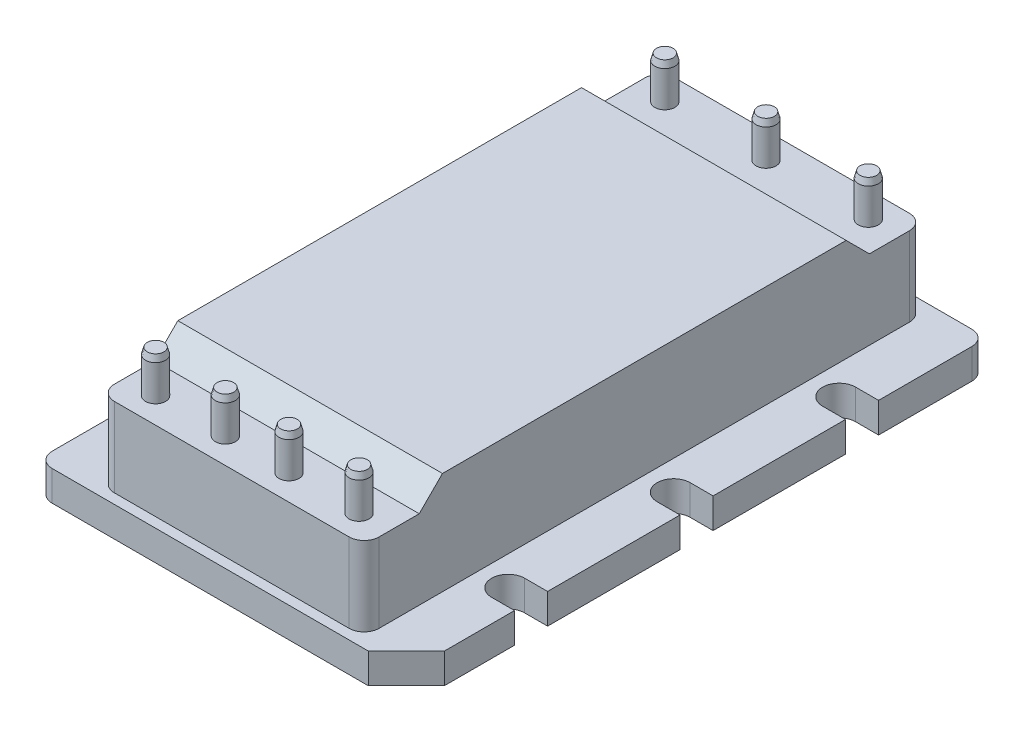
ISO-10303-21;
HEADER;
FILE_DESCRIPTION(('STEP AP214'),'2;1');
FILE_NAME('part.step','',(''),(''),'','','');
FILE_SCHEMA(('AUTOMOTIVE_DESIGN { 1 0 10303 214 1 1 1 1 }'));
ENDSEC;
DATA;
#1=APPLICATION_CONTEXT('core data for automotive mechanical design processes');
#2=APPLICATION_PROTOCOL_DEFINITION('international standard','automotive_design',2000,#1);
#3=PRODUCT_CONTEXT('',#1,'mechanical');
#4=PRODUCT('Part','Part','',(#3));
#5=PRODUCT_RELATED_PRODUCT_CATEGORY('part','',(#4));
#6=PRODUCT_DEFINITION_FORMATION('','',#4);
#7=PRODUCT_DEFINITION_CONTEXT('part definition',#1,'design');
#8=PRODUCT_DEFINITION('design','',#6,#7);
#9=PRODUCT_DEFINITION_SHAPE('','',#8);
#10=(LENGTH_UNIT() NAMED_UNIT(*) SI_UNIT(.MILLI.,.METRE.));
#11=(NAMED_UNIT(*) PLANE_ANGLE_UNIT() SI_UNIT($,.RADIAN.));
#12=(NAMED_UNIT(*) SI_UNIT($,.STERADIAN.) SOLID_ANGLE_UNIT());
#13=UNCERTAINTY_MEASURE_WITH_UNIT(LENGTH_MEASURE(1.E-05),#10,'distance_accuracy_value','');
#14=(GEOMETRIC_REPRESENTATION_CONTEXT(3) GLOBAL_UNCERTAINTY_ASSIGNED_CONTEXT((#13)) GLOBAL_UNIT_ASSIGNED_CONTEXT((#10,
#11,#12)) REPRESENTATION_CONTEXT('',''));
#15=CARTESIAN_POINT('',(0.,0.,0.));
#16=DIRECTION('',(0.,0.,1.));
#17=DIRECTION('',(1.,0.,0.));
#18=AXIS2_PLACEMENT_3D('',#15,#16,#17);
#19=CARTESIAN_POINT('',(36.83,10.9,-56.91));
#20=DIRECTION('',(0.,-1.,0.));
#21=DIRECTION('',(0.,0.,-1.));
#22=AXIS2_PLACEMENT_3D('',#19,#20,#21);
#23=PLANE('',#22);
#24=CARTESIAN_POINT('',(18.365,10.9,-54.35));
#25=DIRECTION('',(0.,-1.,0.));
#26=DIRECTION('',(0.,0.,-1.));
#27=AXIS2_PLACEMENT_3D('',#24,#25,#26);
#28=CIRCLE('',#27,1.);
#29=CARTESIAN_POINT('',(18.365,10.9,-55.35));
#30=VERTEX_POINT('',#29);
#31=EDGE_CURVE('E649',#30,#30,#28,.F.);
#32=ORIENTED_EDGE('',*,*,#31,.F.);
#33=EDGE_LOOP('',(#32));
#34=FACE_BOUND('',#33,.T.);
#35=DIRECTION('',(0.,0.,1.));
#36=VECTOR('',#35,1.);
#37=CARTESIAN_POINT('',(5.215,10.9,-56.91));
#38=LINE('',#37,#36);
#39=CARTESIAN_POINT('',(5.215,10.9,-55.41));
#40=VERTEX_POINT('',#39);
#41=CARTESIAN_POINT('',(5.215,10.9,-51.41));
#42=VERTEX_POINT('',#41);
#43=EDGE_CURVE('E347',#40,#42,#38,.T.);
#44=ORIENTED_EDGE('',*,*,#43,.T.);
#45=DIRECTION('',(-1.,0.,0.));
#46=VECTOR('',#45,1.);
#47=CARTESIAN_POINT('',(36.83,10.9,-51.41));
#48=LINE('',#47,#46);
#49=CARTESIAN_POINT('',(31.615,10.9,-51.41));
#50=VERTEX_POINT('',#49);
#51=EDGE_CURVE('E351',#50,#42,#48,.T.);
#52=ORIENTED_EDGE('',*,*,#51,.F.);
#53=DIRECTION('',(0.,0.,1.));
#54=VECTOR('',#53,1.);
#55=CARTESIAN_POINT('',(31.615,10.9,-55.41));
#56=LINE('',#55,#54);
#57=CARTESIAN_POINT('',(31.615,10.9,-55.41));
#58=VERTEX_POINT('',#57);
#59=EDGE_CURVE('E358',#58,#50,#56,.T.);
#60=ORIENTED_EDGE('',*,*,#59,.F.);
#61=CARTESIAN_POINT('',(30.115,10.9,-55.41));
#62=DIRECTION('',(0.,-1.,0.));
#63=DIRECTION('',(0.,0.,-1.));
#64=AXIS2_PLACEMENT_3D('',#61,#62,#63);
#65=CIRCLE('',#64,1.5);
#66=CARTESIAN_POINT('',(30.115,10.9,-56.91));
#67=VERTEX_POINT('',#66);
#68=EDGE_CURVE('E354',#67,#58,#65,.T.);
#69=ORIENTED_EDGE('',*,*,#68,.F.);
#70=DIRECTION('',(-1.,0.,0.));
#71=VECTOR('',#70,1.);
#72=CARTESIAN_POINT('',(36.83,10.9,-56.91));
#73=LINE('',#72,#71);
#74=CARTESIAN_POINT('',(6.71500000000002,10.9,-56.91));
#75=VERTEX_POINT('',#74);
#76=EDGE_CURVE('E350',#67,#75,#73,.T.);
#77=ORIENTED_EDGE('',*,*,#76,.T.);
#78=CARTESIAN_POINT('',(6.715,10.9,-55.41));
#79=DIRECTION('',(0.,-1.,0.));
#80=DIRECTION('',(0.,0.,-1.));
#81=AXIS2_PLACEMENT_3D('',#78,#79,#80);
#82=CIRCLE('',#81,1.5);
#83=EDGE_CURVE('E361',#40,#75,#82,.T.);
#84=ORIENTED_EDGE('',*,*,#83,.F.);
#85=EDGE_LOOP('',(#44,#52,#60,#69,#77,#84));
#86=FACE_BOUND('',#85,.T.);
#87=CARTESIAN_POINT('',(28.565,10.9,-54.35));
#88=DIRECTION('',(0.,-1.,0.));
#89=DIRECTION('',(0.,0.,-1.));
#90=AXIS2_PLACEMENT_3D('',#87,#88,#89);
#91=CIRCLE('',#90,1.);
#92=CARTESIAN_POINT('',(28.565,10.9,-55.35));
#93=VERTEX_POINT('',#92);
#94=EDGE_CURVE('E646',#93,#93,#91,.F.);
#95=ORIENTED_EDGE('',*,*,#94,.F.);
#96=EDGE_LOOP('',(#95));
#97=FACE_BOUND('',#96,.T.);
#98=CARTESIAN_POINT('',(8.265,10.9,-54.35));
#99=DIRECTION('',(0.,-1.,0.));
#100=DIRECTION('',(0.,0.,-1.));
#101=AXIS2_PLACEMENT_3D('',#98,#99,#100);
#102=CIRCLE('',#101,1.);
#103=CARTESIAN_POINT('',(8.265,10.9,-55.35));
#104=VERTEX_POINT('',#103);
#105=EDGE_CURVE('E652',#104,#104,#102,.F.);
#106=ORIENTED_EDGE('',*,*,#105,.F.);
#107=EDGE_LOOP('',(#106));
#108=FACE_BOUND('',#107,.T.);
#109=ADVANCED_FACE('F35',(#34,#86,#97,#108),#23,.F.);
#110=CARTESIAN_POINT('',(36.83,10.9,-1.));
#111=DIRECTION('',(0.,-1.,0.));
#112=DIRECTION('',(0.,0.,-1.));
#113=AXIS2_PLACEMENT_3D('',#110,#111,#112);
#114=PLANE('',#113);
#115=CARTESIAN_POINT('',(15.225,10.9,-3.55));
#116=DIRECTION('',(0.,-1.,0.));
#117=DIRECTION('',(0.,0.,-1.));
#118=AXIS2_PLACEMENT_3D('',#115,#116,#117);
#119=CIRCLE('',#118,1.);
#120=CARTESIAN_POINT('',(15.225,10.9,-4.55));
#121=VERTEX_POINT('',#120);
#122=EDGE_CURVE('E640',#121,#121,#119,.F.);
#123=ORIENTED_EDGE('',*,*,#122,.F.);
#124=EDGE_LOOP('',(#123));
#125=FACE_BOUND('',#124,.T.);
#126=CARTESIAN_POINT('',(28.565,10.9,-3.55));
#127=DIRECTION('',(0.,-1.,0.));
#128=DIRECTION('',(0.,0.,-1.));
#129=AXIS2_PLACEMENT_3D('',#126,#127,#128);
#130=CIRCLE('',#129,1.);
#131=CARTESIAN_POINT('',(28.565,10.9,-4.55));
#132=VERTEX_POINT('',#131);
#133=EDGE_CURVE('E634',#132,#132,#130,.F.);
#134=ORIENTED_EDGE('',*,*,#133,.F.);
#135=EDGE_LOOP('',(#134));
#136=FACE_BOUND('',#135,.T.);
#137=DIRECTION('',(-1.,0.,0.));
#138=VECTOR('',#137,1.);
#139=CARTESIAN_POINT('',(36.83,10.9,-1.));
#140=LINE('',#139,#138);
#141=CARTESIAN_POINT('',(30.115,10.9,-1.));
#142=VERTEX_POINT('',#141);
#143=CARTESIAN_POINT('',(6.71500000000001,10.9,-1.));
#144=VERTEX_POINT('',#143);
#145=EDGE_CURVE('E332',#142,#144,#140,.T.);
#146=ORIENTED_EDGE('',*,*,#145,.F.);
#147=CARTESIAN_POINT('',(30.115,10.9,-2.5));
#148=DIRECTION('',(0.,-1.,0.));
#149=DIRECTION('',(0.,0.,-1.));
#150=AXIS2_PLACEMENT_3D('',#147,#148,#149);
#151=CIRCLE('',#150,1.5);
#152=CARTESIAN_POINT('',(31.615,10.9,-2.50000000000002));
#153=VERTEX_POINT('',#152);
#154=EDGE_CURVE('E341',#153,#142,#151,.T.);
#155=ORIENTED_EDGE('',*,*,#154,.F.);
#156=DIRECTION('',(0.,0.,1.));
#157=VECTOR('',#156,1.);
#158=CARTESIAN_POINT('',(31.615,10.9,-55.41));
#159=LINE('',#158,#157);
#160=CARTESIAN_POINT('',(31.615,10.9,-6.5));
#161=VERTEX_POINT('',#160);
#162=EDGE_CURVE('E331',#161,#153,#159,.T.);
#163=ORIENTED_EDGE('',*,*,#162,.F.);
#164=DIRECTION('',(-1.,0.,0.));
#165=VECTOR('',#164,1.);
#166=CARTESIAN_POINT('',(36.83,10.9,-6.5));
#167=LINE('',#166,#165);
#168=CARTESIAN_POINT('',(5.215,10.9,-6.5));
#169=VERTEX_POINT('',#168);
#170=EDGE_CURVE('E320',#161,#169,#167,.T.);
#171=ORIENTED_EDGE('',*,*,#170,.T.);
#172=DIRECTION('',(0.,0.,1.));
#173=VECTOR('',#172,1.);
#174=CARTESIAN_POINT('',(5.215,10.9,-1.));
#175=LINE('',#174,#173);
#176=CARTESIAN_POINT('',(5.215,10.9,-2.5));
#177=VERTEX_POINT('',#176);
#178=EDGE_CURVE('E328',#169,#177,#175,.T.);
#179=ORIENTED_EDGE('',*,*,#178,.T.);
#180=CARTESIAN_POINT('',(6.715,10.9,-2.5));
#181=DIRECTION('',(0.,-1.,0.));
#182=DIRECTION('',(0.,0.,-1.));
#183=AXIS2_PLACEMENT_3D('',#180,#181,#182);
#184=CIRCLE('',#183,1.5);
#185=EDGE_CURVE('E345',#144,#177,#184,.T.);
#186=ORIENTED_EDGE('',*,*,#185,.F.);
#187=EDGE_LOOP('',(#146,#155,#163,#171,#179,#186));
#188=FACE_BOUND('',#187,.T.);
#189=CARTESIAN_POINT('',(21.575,10.9,-3.55));
#190=DIRECTION('',(0.,-1.,0.));
#191=DIRECTION('',(0.,0.,-1.));
#192=AXIS2_PLACEMENT_3D('',#189,#190,#191);
#193=CIRCLE('',#192,1.);
#194=CARTESIAN_POINT('',(21.575,10.9,-4.55));
#195=VERTEX_POINT('',#194);
#196=EDGE_CURVE('E637',#195,#195,#193,.F.);
#197=ORIENTED_EDGE('',*,*,#196,.F.);
#198=EDGE_LOOP('',(#197));
#199=FACE_BOUND('',#198,.T.);
#200=CARTESIAN_POINT('',(8.265,10.9,-3.55));
#201=DIRECTION('',(0.,-1.,0.));
#202=DIRECTION('',(0.,0.,-1.));
#203=AXIS2_PLACEMENT_3D('',#200,#201,#202);
#204=CIRCLE('',#203,1.);
#205=CARTESIAN_POINT('',(8.265,10.9,-4.55));
#206=VERTEX_POINT('',#205);
#207=EDGE_CURVE('E643',#206,#206,#204,.F.);
#208=ORIENTED_EDGE('',*,*,#207,.F.);
#209=EDGE_LOOP('',(#208));
#210=FACE_BOUND('',#209,.T.);
#211=ADVANCED_FACE('F326',(#125,#136,#188,#199,#210),#114,.F.);
#212=CARTESIAN_POINT('',(0.,3.,-57.91));
#213=DIRECTION('',(0.,-1.,0.));
#214=DIRECTION('',(0.,0.,-1.));
#215=AXIS2_PLACEMENT_3D('',#212,#213,#214);
#216=PLANE('',#215);
#217=CARTESIAN_POINT('',(6.715,3.,-55.41));
#218=DIRECTION('',(0.,1.,0.));
#219=DIRECTION('',(0.,0.,1.));
#220=AXIS2_PLACEMENT_3D('',#217,#218,#219);
#221=CIRCLE('',#220,1.5);
#222=CARTESIAN_POINT('',(6.71500000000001,3.,-56.91));
#223=VERTEX_POINT('',#222);
#224=CARTESIAN_POINT('',(5.215,3.,-55.41));
#225=VERTEX_POINT('',#224);
#226=EDGE_CURVE('E464',#223,#225,#221,.T.);
#227=ORIENTED_EDGE('',*,*,#226,.F.);
#228=DIRECTION('',(-1.,0.,0.));
#229=VECTOR('',#228,1.);
#230=CARTESIAN_POINT('',(6.71500000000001,3.,-56.91));
#231=LINE('',#230,#229);
#232=CARTESIAN_POINT('',(30.115,3.,-56.91));
#233=VERTEX_POINT('',#232);
#234=EDGE_CURVE('E474',#233,#223,#231,.T.);
#235=ORIENTED_EDGE('',*,*,#234,.F.);
#236=CARTESIAN_POINT('',(30.115,3.,-55.41));
#237=DIRECTION('',(0.,1.,0.));
#238=DIRECTION('',(0.,0.,-1.));
#239=AXIS2_PLACEMENT_3D('',#236,#237,#238);
#240=CIRCLE('',#239,1.5);
#241=CARTESIAN_POINT('',(31.615,3.,-55.41));
#242=VERTEX_POINT('',#241);
#243=EDGE_CURVE('E493',#242,#233,#240,.T.);
#244=ORIENTED_EDGE('',*,*,#243,.F.);
#245=DIRECTION('',(0.,0.,-1.));
#246=VECTOR('',#245,1.);
#247=CARTESIAN_POINT('',(31.615,3.,-55.41));
#248=LINE('',#247,#246);
#249=CARTESIAN_POINT('',(31.615,3.,-2.50000000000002));
#250=VERTEX_POINT('',#249);
#251=EDGE_CURVE('E490',#250,#242,#248,.T.);
#252=ORIENTED_EDGE('',*,*,#251,.F.);
#253=CARTESIAN_POINT('',(30.115,3.,-2.5));
#254=DIRECTION('',(0.,1.,0.));
#255=DIRECTION('',(0.,0.,1.));
#256=AXIS2_PLACEMENT_3D('',#253,#254,#255);
#257=CIRCLE('',#256,1.5);
#258=CARTESIAN_POINT('',(30.115,3.,-1.));
#259=VERTEX_POINT('',#258);
#260=EDGE_CURVE('E487',#259,#250,#257,.T.);
#261=ORIENTED_EDGE('',*,*,#260,.F.);
#262=DIRECTION('',(1.,0.,0.));
#263=VECTOR('',#262,1.);
#264=CARTESIAN_POINT('',(6.71500000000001,3.,-1.));
#265=LINE('',#264,#263);
#266=CARTESIAN_POINT('',(6.71500000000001,3.,-1.));
#267=VERTEX_POINT('',#266);
#268=EDGE_CURVE('E484',#267,#259,#265,.T.);
#269=ORIENTED_EDGE('',*,*,#268,.F.);
#270=CARTESIAN_POINT('',(6.715,3.,-2.5));
#271=DIRECTION('',(0.,1.,0.));
#272=DIRECTION('',(0.,0.,1.));
#273=AXIS2_PLACEMENT_3D('',#270,#271,#272);
#274=CIRCLE('',#273,1.5);
#275=CARTESIAN_POINT('',(5.215,3.,-2.50000000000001));
#276=VERTEX_POINT('',#275);
#277=EDGE_CURVE('E481',#276,#267,#274,.T.);
#278=ORIENTED_EDGE('',*,*,#277,.F.);
#279=DIRECTION('',(0.,0.,1.));
#280=VECTOR('',#279,1.);
#281=CARTESIAN_POINT('',(5.215,3.,-55.41));
#282=LINE('',#281,#280);
#283=EDGE_CURVE('E479',#225,#276,#282,.T.);
#284=ORIENTED_EDGE('',*,*,#283,.F.);
#285=EDGE_LOOP('',(#227,#235,#244,#252,#261,#269,#278,#284));
#286=FACE_BOUND('',#285,.T.);
#287=DIRECTION('',(-1.,0.,0.));
#288=VECTOR('',#287,1.);
#289=CARTESIAN_POINT('',(0.,3.,-43.81));
#290=LINE('',#289,#288);
#291=CARTESIAN_POINT('',(2.285,3.,-43.81));
#292=VERTEX_POINT('',#291);
#293=CARTESIAN_POINT('',(0.,3.,-43.81));
#294=VERTEX_POINT('',#293);
#295=EDGE_CURVE('E364',#292,#294,#290,.T.);
#296=ORIENTED_EDGE('',*,*,#295,.T.);
#297=DIRECTION('',(0.,0.,1.));
#298=VECTOR('',#297,1.);
#299=CARTESIAN_POINT('',(0.,3.,0.));
#300=LINE('',#299,#298);
#301=CARTESIAN_POINT('',(0.,3.,-30.6));
#302=VERTEX_POINT('',#301);
#303=EDGE_CURVE('E517',#294,#302,#300,.T.);
#304=ORIENTED_EDGE('',*,*,#303,.T.);
#305=DIRECTION('',(-1.,0.,0.));
#306=VECTOR('',#305,1.);
#307=CARTESIAN_POINT('',(0.,3.,-30.6));
#308=LINE('',#307,#306);
#309=CARTESIAN_POINT('',(2.285,3.,-30.6));
#310=VERTEX_POINT('',#309);
#311=EDGE_CURVE('E387',#310,#302,#308,.T.);
#312=ORIENTED_EDGE('',*,*,#311,.F.);
#313=CARTESIAN_POINT('',(2.285,3.,-28.95));
#314=DIRECTION('',(0.,1.,0.));
#315=DIRECTION('',(0.,0.,1.));
#316=AXIS2_PLACEMENT_3D('',#313,#314,#315);
#317=CIRCLE('',#316,1.65);
#318=CARTESIAN_POINT('',(2.285,3.,-27.3));
#319=VERTEX_POINT('',#318);
#320=EDGE_CURVE('E384',#319,#310,#317,.T.);
#321=ORIENTED_EDGE('',*,*,#320,.F.);
#322=DIRECTION('',(-1.,0.,0.));
#323=VECTOR('',#322,1.);
#324=CARTESIAN_POINT('',(0.,3.,-27.3));
#325=LINE('',#324,#323);
#326=CARTESIAN_POINT('',(0.,3.,-27.3));
#327=VERTEX_POINT('',#326);
#328=EDGE_CURVE('E381',#319,#327,#325,.T.);
#329=ORIENTED_EDGE('',*,*,#328,.T.);
#330=CARTESIAN_POINT('',(0.,3.,-14.09));
#331=VERTEX_POINT('',#330);
#332=EDGE_CURVE('E1497',#327,#331,#300,.T.);
#333=ORIENTED_EDGE('',*,*,#332,.T.);
#334=DIRECTION('',(-1.,0.,0.));
#335=VECTOR('',#334,1.);
#336=CARTESIAN_POINT('',(0.,3.,-14.09));
#337=LINE('',#336,#335);
#338=CARTESIAN_POINT('',(2.285,3.,-14.09));
#339=VERTEX_POINT('',#338);
#340=EDGE_CURVE('E405',#339,#331,#337,.T.);
#341=ORIENTED_EDGE('',*,*,#340,.F.);
#342=CARTESIAN_POINT('',(2.285,3.,-12.44));
#343=DIRECTION('',(0.,1.,0.));
#344=DIRECTION('',(0.,0.,1.));
#345=AXIS2_PLACEMENT_3D('',#342,#343,#344);
#346=CIRCLE('',#345,1.65);
#347=CARTESIAN_POINT('',(2.285,3.,-10.79));
#348=VERTEX_POINT('',#347);
#349=EDGE_CURVE('E402',#348,#339,#346,.T.);
#350=ORIENTED_EDGE('',*,*,#349,.F.);
#351=DIRECTION('',(-1.,0.,0.));
#352=VECTOR('',#351,1.);
#353=CARTESIAN_POINT('',(0.,3.,-10.79));
#354=LINE('',#353,#352);
#355=CARTESIAN_POINT('',(0.,3.,-10.79));
#356=VERTEX_POINT('',#355);
#357=EDGE_CURVE('E399',#348,#356,#354,.T.);
#358=ORIENTED_EDGE('',*,*,#357,.T.);
#359=CARTESIAN_POINT('',(0.,3.,-1.5));
#360=VERTEX_POINT('',#359);
#361=EDGE_CURVE('E518',#356,#360,#300,.T.);
#362=ORIENTED_EDGE('',*,*,#361,.T.);
#363=CARTESIAN_POINT('',(1.5,3.,-1.5));
#364=DIRECTION('',(0.,-1.,0.));
#365=DIRECTION('',(0.,0.,-1.));
#366=AXIS2_PLACEMENT_3D('',#363,#364,#365);
#367=CIRCLE('',#366,1.5);
#368=CARTESIAN_POINT('',(1.5,3.,0.));
#369=VERTEX_POINT('',#368);
#370=EDGE_CURVE('E574',#360,#369,#367,.F.);
#371=ORIENTED_EDGE('',*,*,#370,.T.);
#372=DIRECTION('',(1.,0.,0.));
#373=VECTOR('',#372,1.);
#374=CARTESIAN_POINT('',(0.,3.,0.));
#375=LINE('',#374,#373);
#376=CARTESIAN_POINT('',(33.03,3.,0.));
#377=VERTEX_POINT('',#376);
#378=EDGE_CURVE('E516',#369,#377,#375,.T.);
#379=ORIENTED_EDGE('',*,*,#378,.T.);
#380=DIRECTION('',(-0.707106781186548,0.,0.707106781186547));
#381=VECTOR('',#380,1.);
#382=CARTESIAN_POINT('',(36.83,3.,-3.8));
#383=LINE('',#382,#381);
#384=CARTESIAN_POINT('',(36.83,3.,-3.8));
#385=VERTEX_POINT('',#384);
#386=EDGE_CURVE('E551',#377,#385,#383,.F.);
#387=ORIENTED_EDGE('',*,*,#386,.T.);
#388=DIRECTION('',(0.,0.,-1.));
#389=VECTOR('',#388,1.);
#390=CARTESIAN_POINT('',(36.83,3.,0.));
#391=LINE('',#390,#389);
#392=CARTESIAN_POINT('',(36.83,3.,-10.79));
#393=VERTEX_POINT('',#392);
#394=EDGE_CURVE('E521',#385,#393,#391,.T.);
#395=ORIENTED_EDGE('',*,*,#394,.T.);
#396=DIRECTION('',(1.,0.,0.));
#397=VECTOR('',#396,1.);
#398=CARTESIAN_POINT('',(0.,3.,-10.79));
#399=LINE('',#398,#397);
#400=CARTESIAN_POINT('',(34.545,3.,-10.79));
#401=VERTEX_POINT('',#400);
#402=EDGE_CURVE('E420',#401,#393,#399,.T.);
#403=ORIENTED_EDGE('',*,*,#402,.F.);
#404=CARTESIAN_POINT('',(34.545,3.,-12.44));
#405=DIRECTION('',(0.,1.,0.));
#406=DIRECTION('',(0.,0.,1.));
#407=AXIS2_PLACEMENT_3D('',#404,#405,#406);
#408=CIRCLE('',#407,1.65);
#409=CARTESIAN_POINT('',(34.545,3.,-14.09));
#410=VERTEX_POINT('',#409);
#411=EDGE_CURVE('E417',#410,#401,#408,.T.);
#412=ORIENTED_EDGE('',*,*,#411,.F.);
#413=DIRECTION('',(1.,0.,0.));
#414=VECTOR('',#413,1.);
#415=CARTESIAN_POINT('',(0.,3.,-14.09));
#416=LINE('',#415,#414);
#417=CARTESIAN_POINT('',(36.83,3.,-14.09));
#418=VERTEX_POINT('',#417);
#419=EDGE_CURVE('E422',#410,#418,#416,.T.);
#420=ORIENTED_EDGE('',*,*,#419,.T.);
#421=CARTESIAN_POINT('',(36.83,3.,-27.3));
#422=VERTEX_POINT('',#421);
#423=EDGE_CURVE('E525',#418,#422,#391,.T.);
#424=ORIENTED_EDGE('',*,*,#423,.T.);
#425=DIRECTION('',(1.,0.,0.));
#426=VECTOR('',#425,1.);
#427=CARTESIAN_POINT('',(0.,3.,-27.3));
#428=LINE('',#427,#426);
#429=CARTESIAN_POINT('',(34.545,3.,-27.3));
#430=VERTEX_POINT('',#429);
#431=EDGE_CURVE('E440',#430,#422,#428,.T.);
#432=ORIENTED_EDGE('',*,*,#431,.F.);
#433=CARTESIAN_POINT('',(34.545,3.,-28.95));
#434=DIRECTION('',(0.,1.,0.));
#435=DIRECTION('',(0.,0.,1.));
#436=AXIS2_PLACEMENT_3D('',#433,#434,#435);
#437=CIRCLE('',#436,1.65);
#438=CARTESIAN_POINT('',(34.545,3.,-30.6));
#439=VERTEX_POINT('',#438);
#440=EDGE_CURVE('E437',#439,#430,#437,.T.);
#441=ORIENTED_EDGE('',*,*,#440,.F.);
#442=DIRECTION('',(1.,0.,0.));
#443=VECTOR('',#442,1.);
#444=CARTESIAN_POINT('',(0.,3.,-30.6));
#445=LINE('',#444,#443);
#446=CARTESIAN_POINT('',(36.83,3.,-30.6));
#447=VERTEX_POINT('',#446);
#448=EDGE_CURVE('E434',#439,#447,#445,.T.);
#449=ORIENTED_EDGE('',*,*,#448,.T.);
#450=CARTESIAN_POINT('',(36.83,3.,-43.81));
#451=VERTEX_POINT('',#450);
#452=EDGE_CURVE('E1475',#447,#451,#391,.T.);
#453=ORIENTED_EDGE('',*,*,#452,.T.);
#454=DIRECTION('',(1.,0.,0.));
#455=VECTOR('',#454,1.);
#456=CARTESIAN_POINT('',(0.,3.,-43.81));
#457=LINE('',#456,#455);
#458=CARTESIAN_POINT('',(34.545,3.,-43.81));
#459=VERTEX_POINT('',#458);
#460=EDGE_CURVE('E455',#459,#451,#457,.T.);
#461=ORIENTED_EDGE('',*,*,#460,.F.);
#462=CARTESIAN_POINT('',(34.545,3.,-45.46));
#463=DIRECTION('',(0.,1.,0.));
#464=DIRECTION('',(0.,0.,1.));
#465=AXIS2_PLACEMENT_3D('',#462,#463,#464);
#466=CIRCLE('',#465,1.65);
#467=CARTESIAN_POINT('',(34.545,3.,-47.11));
#468=VERTEX_POINT('',#467);
#469=EDGE_CURVE('E452',#468,#459,#466,.T.);
#470=ORIENTED_EDGE('',*,*,#469,.F.);
#471=DIRECTION('',(1.,0.,0.));
#472=VECTOR('',#471,1.);
#473=CARTESIAN_POINT('',(0.,3.,-47.11));
#474=LINE('',#473,#472);
#475=CARTESIAN_POINT('',(36.83,3.,-47.11));
#476=VERTEX_POINT('',#475);
#477=EDGE_CURVE('E458',#468,#476,#474,.T.);
#478=ORIENTED_EDGE('',*,*,#477,.T.);
#479=CARTESIAN_POINT('',(36.83,3.,-56.41));
#480=VERTEX_POINT('',#479);
#481=EDGE_CURVE('E520',#476,#480,#391,.T.);
#482=ORIENTED_EDGE('',*,*,#481,.T.);
#483=CARTESIAN_POINT('',(35.33,3.,-56.41));
#484=DIRECTION('',(0.,-1.,0.));
#485=DIRECTION('',(0.,0.,-1.));
#486=AXIS2_PLACEMENT_3D('',#483,#484,#485);
#487=CIRCLE('',#486,1.5);
#488=CARTESIAN_POINT('',(35.33,3.,-57.91));
#489=VERTEX_POINT('',#488);
#490=EDGE_CURVE('E572',#480,#489,#487,.F.);
#491=ORIENTED_EDGE('',*,*,#490,.T.);
#492=DIRECTION('',(-1.,0.,0.));
#493=VECTOR('',#492,1.);
#494=CARTESIAN_POINT('',(0.,3.,-57.91));
#495=LINE('',#494,#493);
#496=CARTESIAN_POINT('',(1.5,3.,-57.91));
#497=VERTEX_POINT('',#496);
#498=EDGE_CURVE('E524',#489,#497,#495,.T.);
#499=ORIENTED_EDGE('',*,*,#498,.T.);
#500=CARTESIAN_POINT('',(1.5,3.,-56.41));
#501=DIRECTION('',(0.,-1.,0.));
#502=DIRECTION('',(0.,0.,-1.));
#503=AXIS2_PLACEMENT_3D('',#500,#501,#502);
#504=CIRCLE('',#503,1.5);
#505=CARTESIAN_POINT('',(0.,3.,-56.41));
#506=VERTEX_POINT('',#505);
#507=EDGE_CURVE('E576',#497,#506,#504,.F.);
#508=ORIENTED_EDGE('',*,*,#507,.T.);
#509=CARTESIAN_POINT('',(0.,3.,-47.11));
#510=VERTEX_POINT('',#509);
#511=EDGE_CURVE('E513',#506,#510,#300,.T.);
#512=ORIENTED_EDGE('',*,*,#511,.T.);
#513=DIRECTION('',(-1.,0.,0.));
#514=VECTOR('',#513,1.);
#515=CARTESIAN_POINT('',(0.,3.,-47.11));
#516=LINE('',#515,#514);
#517=CARTESIAN_POINT('',(2.285,3.,-47.11));
#518=VERTEX_POINT('',#517);
#519=EDGE_CURVE('E370',#518,#510,#516,.T.);
#520=ORIENTED_EDGE('',*,*,#519,.F.);
#521=CARTESIAN_POINT('',(2.285,3.,-45.46));
#522=DIRECTION('',(0.,1.,0.));
#523=DIRECTION('',(0.,0.,1.));
#524=AXIS2_PLACEMENT_3D('',#521,#522,#523);
#525=CIRCLE('',#524,1.65);
#526=EDGE_CURVE('E367',#292,#518,#525,.T.);
#527=ORIENTED_EDGE('',*,*,#526,.F.);
#528=EDGE_LOOP('',(#296,#304,#312,#321,#329,#333,#341,#350,#358,#362,#371,#379,#387,#395,#403,
#412,#420,#424,#432,#441,#449,#453,#461,#470,#478,#482,#491,#499,#508,#512,#520,#527));
#529=FACE_BOUND('',#528,.T.);
#530=ADVANCED_FACE('F710',(#286,#529),#216,.F.);
#531=CARTESIAN_POINT('',(0.,0.,-57.91));
#532=DIRECTION('',(0.,-1.,0.));
#533=DIRECTION('',(0.,0.,-1.));
#534=AXIS2_PLACEMENT_3D('',#531,#532,#533);
#535=PLANE('',#534);
#536=DIRECTION('',(0.,0.,1.));
#537=VECTOR('',#536,1.);
#538=CARTESIAN_POINT('',(0.,0.,0.));
#539=LINE('',#538,#537);
#540=CARTESIAN_POINT('',(0.,0.,-43.81));
#541=VERTEX_POINT('',#540);
#542=CARTESIAN_POINT('',(0.,0.,-30.6));
#543=VERTEX_POINT('',#542);
#544=EDGE_CURVE('E533',#541,#543,#539,.T.);
#545=ORIENTED_EDGE('',*,*,#544,.F.);
#546=DIRECTION('',(1.,0.,0.));
#547=VECTOR('',#546,1.);
#548=CARTESIAN_POINT('',(0.,0.,-43.81));
#549=LINE('',#548,#547);
#550=CARTESIAN_POINT('',(2.285,0.,-43.81));
#551=VERTEX_POINT('',#550);
#552=EDGE_CURVE('E378',#541,#551,#549,.T.);
#553=ORIENTED_EDGE('',*,*,#552,.T.);
#554=CARTESIAN_POINT('',(2.285,0.,-45.46));
#555=DIRECTION('',(0.,-1.,0.));
#556=DIRECTION('',(0.,0.,-1.));
#557=AXIS2_PLACEMENT_3D('',#554,#555,#556);
#558=CIRCLE('',#557,1.65);
#559=CARTESIAN_POINT('',(2.285,0.,-47.11));
#560=VERTEX_POINT('',#559);
#561=EDGE_CURVE('E624',#560,#551,#558,.T.);
#562=ORIENTED_EDGE('',*,*,#561,.F.);
#563=DIRECTION('',(1.,0.,0.));
#564=VECTOR('',#563,1.);
#565=CARTESIAN_POINT('',(0.,0.,-47.11));
#566=LINE('',#565,#564);
#567=CARTESIAN_POINT('',(0.,0.,-47.11));
#568=VERTEX_POINT('',#567);
#569=EDGE_CURVE('E375',#568,#560,#566,.T.);
#570=ORIENTED_EDGE('',*,*,#569,.F.);
#571=CARTESIAN_POINT('',(0.,0.,-56.41));
#572=VERTEX_POINT('',#571);
#573=EDGE_CURVE('E529',#572,#568,#539,.T.);
#574=ORIENTED_EDGE('',*,*,#573,.F.);
#575=CARTESIAN_POINT('',(1.5,0.,-56.41));
#576=DIRECTION('',(0.,-1.,0.));
#577=DIRECTION('',(0.,0.,-1.));
#578=AXIS2_PLACEMENT_3D('',#575,#576,#577);
#579=CIRCLE('',#578,1.5);
#580=CARTESIAN_POINT('',(1.5,0.,-57.91));
#581=VERTEX_POINT('',#580);
#582=EDGE_CURVE('E565',#572,#581,#579,.T.);
#583=ORIENTED_EDGE('',*,*,#582,.T.);
#584=DIRECTION('',(-1.,0.,0.));
#585=VECTOR('',#584,1.);
#586=CARTESIAN_POINT('',(0.,0.,-57.91));
#587=LINE('',#586,#585);
#588=CARTESIAN_POINT('',(35.33,0.,-57.91));
#589=VERTEX_POINT('',#588);
#590=EDGE_CURVE('E539',#589,#581,#587,.T.);
#591=ORIENTED_EDGE('',*,*,#590,.F.);
#592=CARTESIAN_POINT('',(35.33,0.,-56.41));
#593=DIRECTION('',(0.,-1.,0.));
#594=DIRECTION('',(0.,0.,-1.));
#595=AXIS2_PLACEMENT_3D('',#592,#593,#594);
#596=CIRCLE('',#595,1.5);
#597=CARTESIAN_POINT('',(36.83,0.,-56.41));
#598=VERTEX_POINT('',#597);
#599=EDGE_CURVE('E559',#589,#598,#596,.T.);
#600=ORIENTED_EDGE('',*,*,#599,.T.);
#601=DIRECTION('',(0.,0.,-1.));
#602=VECTOR('',#601,1.);
#603=CARTESIAN_POINT('',(36.83,0.,0.));
#604=LINE('',#603,#602);
#605=CARTESIAN_POINT('',(36.83,0.,-47.11));
#606=VERTEX_POINT('',#605);
#607=EDGE_CURVE('E535',#606,#598,#604,.T.);
#608=ORIENTED_EDGE('',*,*,#607,.F.);
#609=DIRECTION('',(-1.,0.,0.));
#610=VECTOR('',#609,1.);
#611=CARTESIAN_POINT('',(0.,0.,-47.11));
#612=LINE('',#611,#610);
#613=CARTESIAN_POINT('',(34.545,0.,-47.11));
#614=VERTEX_POINT('',#613);
#615=EDGE_CURVE('E588',#606,#614,#612,.T.);
#616=ORIENTED_EDGE('',*,*,#615,.T.);
#617=CARTESIAN_POINT('',(34.545,0.,-45.46));
#618=DIRECTION('',(0.,-1.,0.));
#619=DIRECTION('',(0.,0.,-1.));
#620=AXIS2_PLACEMENT_3D('',#617,#618,#619);
#621=CIRCLE('',#620,1.65);
#622=CARTESIAN_POINT('',(34.545,0.,-43.81));
#623=VERTEX_POINT('',#622);
#624=EDGE_CURVE('E586',#623,#614,#621,.T.);
#625=ORIENTED_EDGE('',*,*,#624,.F.);
#626=DIRECTION('',(-1.,0.,0.));
#627=VECTOR('',#626,1.);
#628=CARTESIAN_POINT('',(0.,0.,-43.81));
#629=LINE('',#628,#627);
#630=CARTESIAN_POINT('',(36.83,0.,-43.81));
#631=VERTEX_POINT('',#630);
#632=EDGE_CURVE('E584',#631,#623,#629,.T.);
#633=ORIENTED_EDGE('',*,*,#632,.F.);
#634=CARTESIAN_POINT('',(36.83,0.,-30.6));
#635=VERTEX_POINT('',#634);
#636=EDGE_CURVE('E1456',#635,#631,#604,.T.);
#637=ORIENTED_EDGE('',*,*,#636,.F.);
#638=DIRECTION('',(-1.,0.,0.));
#639=VECTOR('',#638,1.);
#640=CARTESIAN_POINT('',(0.,0.,-30.6));
#641=LINE('',#640,#639);
#642=CARTESIAN_POINT('',(34.545,0.,-30.6));
#643=VERTEX_POINT('',#642);
#644=EDGE_CURVE('E449',#635,#643,#641,.T.);
#645=ORIENTED_EDGE('',*,*,#644,.T.);
#646=CARTESIAN_POINT('',(34.545,0.,-28.95));
#647=DIRECTION('',(0.,-1.,0.));
#648=DIRECTION('',(0.,0.,-1.));
#649=AXIS2_PLACEMENT_3D('',#646,#647,#648);
#650=CIRCLE('',#649,1.65);
#651=CARTESIAN_POINT('',(34.545,0.,-27.3));
#652=VERTEX_POINT('',#651);
#653=EDGE_CURVE('E596',#652,#643,#650,.T.);
#654=ORIENTED_EDGE('',*,*,#653,.F.);
#655=DIRECTION('',(-1.,0.,0.));
#656=VECTOR('',#655,1.);
#657=CARTESIAN_POINT('',(0.,0.,-27.3));
#658=LINE('',#657,#656);
#659=CARTESIAN_POINT('',(36.83,0.,-27.3));
#660=VERTEX_POINT('',#659);
#661=EDGE_CURVE('E446',#660,#652,#658,.T.);
#662=ORIENTED_EDGE('',*,*,#661,.F.);
#663=CARTESIAN_POINT('',(36.83,0.,-14.09));
#664=VERTEX_POINT('',#663);
#665=EDGE_CURVE('E540',#664,#660,#604,.T.);
#666=ORIENTED_EDGE('',*,*,#665,.F.);
#667=DIRECTION('',(-1.,0.,0.));
#668=VECTOR('',#667,1.);
#669=CARTESIAN_POINT('',(0.,0.,-14.09));
#670=LINE('',#669,#668);
#671=CARTESIAN_POINT('',(34.545,0.,-14.09));
#672=VERTEX_POINT('',#671);
#673=EDGE_CURVE('E431',#664,#672,#670,.T.);
#674=ORIENTED_EDGE('',*,*,#673,.T.);
#675=CARTESIAN_POINT('',(34.545,0.,-12.44));
#676=DIRECTION('',(0.,-1.,0.));
#677=DIRECTION('',(0.,0.,-1.));
#678=AXIS2_PLACEMENT_3D('',#675,#676,#677);
#679=CIRCLE('',#678,1.65);
#680=CARTESIAN_POINT('',(34.545,0.,-10.79));
#681=VERTEX_POINT('',#680);
#682=EDGE_CURVE('E603',#681,#672,#679,.T.);
#683=ORIENTED_EDGE('',*,*,#682,.F.);
#684=DIRECTION('',(-1.,0.,0.));
#685=VECTOR('',#684,1.);
#686=CARTESIAN_POINT('',(0.,0.,-10.79));
#687=LINE('',#686,#685);
#688=CARTESIAN_POINT('',(36.83,0.,-10.79));
#689=VERTEX_POINT('',#688);
#690=EDGE_CURVE('E428',#689,#681,#687,.T.);
#691=ORIENTED_EDGE('',*,*,#690,.F.);
#692=CARTESIAN_POINT('',(36.83,0.,-3.80000000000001));
#693=VERTEX_POINT('',#692);
#694=EDGE_CURVE('E536',#693,#689,#604,.T.);
#695=ORIENTED_EDGE('',*,*,#694,.F.);
#696=DIRECTION('',(0.707106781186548,0.,-0.707106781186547));
#697=VECTOR('',#696,1.);
#698=CARTESIAN_POINT('',(45.47,0.,-12.44));
#699=LINE('',#698,#697);
#700=CARTESIAN_POINT('',(33.03,0.,0.));
#701=VERTEX_POINT('',#700);
#702=EDGE_CURVE('E545',#693,#701,#699,.F.);
#703=ORIENTED_EDGE('',*,*,#702,.T.);
#704=DIRECTION('',(1.,0.,0.));
#705=VECTOR('',#704,1.);
#706=CARTESIAN_POINT('',(0.,0.,0.));
#707=LINE('',#706,#705);
#708=CARTESIAN_POINT('',(1.5,0.,0.));
#709=VERTEX_POINT('',#708);
#710=EDGE_CURVE('E532',#709,#701,#707,.T.);
#711=ORIENTED_EDGE('',*,*,#710,.F.);
#712=CARTESIAN_POINT('',(1.5,0.,-1.5));
#713=DIRECTION('',(0.,-1.,0.));
#714=DIRECTION('',(0.,0.,-1.));
#715=AXIS2_PLACEMENT_3D('',#712,#713,#714);
#716=CIRCLE('',#715,1.5);
#717=CARTESIAN_POINT('',(0.,0.,-1.5));
#718=VERTEX_POINT('',#717);
#719=EDGE_CURVE('E562',#709,#718,#716,.T.);
#720=ORIENTED_EDGE('',*,*,#719,.T.);
#721=CARTESIAN_POINT('',(0.,0.,-10.79));
#722=VERTEX_POINT('',#721);
#723=EDGE_CURVE('E512',#722,#718,#539,.T.);
#724=ORIENTED_EDGE('',*,*,#723,.F.);
#725=DIRECTION('',(1.,0.,0.));
#726=VECTOR('',#725,1.);
#727=CARTESIAN_POINT('',(0.,0.,-10.79));
#728=LINE('',#727,#726);
#729=CARTESIAN_POINT('',(2.285,0.,-10.79));
#730=VERTEX_POINT('',#729);
#731=EDGE_CURVE('E414',#722,#730,#728,.T.);
#732=ORIENTED_EDGE('',*,*,#731,.T.);
#733=CARTESIAN_POINT('',(2.285,0.,-12.44));
#734=DIRECTION('',(0.,-1.,0.));
#735=DIRECTION('',(0.,0.,-1.));
#736=AXIS2_PLACEMENT_3D('',#733,#734,#735);
#737=CIRCLE('',#736,1.65);
#738=CARTESIAN_POINT('',(2.285,0.,-14.09));
#739=VERTEX_POINT('',#738);
#740=EDGE_CURVE('E610',#739,#730,#737,.T.);
#741=ORIENTED_EDGE('',*,*,#740,.F.);
#742=DIRECTION('',(1.,0.,0.));
#743=VECTOR('',#742,1.);
#744=CARTESIAN_POINT('',(0.,0.,-14.09));
#745=LINE('',#744,#743);
#746=CARTESIAN_POINT('',(0.,0.,-14.09));
#747=VERTEX_POINT('',#746);
#748=EDGE_CURVE('E411',#747,#739,#745,.T.);
#749=ORIENTED_EDGE('',*,*,#748,.F.);
#750=CARTESIAN_POINT('',(0.,0.,-27.3));
#751=VERTEX_POINT('',#750);
#752=EDGE_CURVE('E1521',#751,#747,#539,.T.);
#753=ORIENTED_EDGE('',*,*,#752,.F.);
#754=DIRECTION('',(1.,0.,0.));
#755=VECTOR('',#754,1.);
#756=CARTESIAN_POINT('',(0.,0.,-27.3));
#757=LINE('',#756,#755);
#758=CARTESIAN_POINT('',(2.285,0.,-27.3));
#759=VERTEX_POINT('',#758);
#760=EDGE_CURVE('E396',#751,#759,#757,.T.);
#761=ORIENTED_EDGE('',*,*,#760,.T.);
#762=CARTESIAN_POINT('',(2.285,0.,-28.95));
#763=DIRECTION('',(0.,-1.,0.));
#764=DIRECTION('',(0.,0.,-1.));
#765=AXIS2_PLACEMENT_3D('',#762,#763,#764);
#766=CIRCLE('',#765,1.65);
#767=CARTESIAN_POINT('',(2.285,0.,-30.6));
#768=VERTEX_POINT('',#767);
#769=EDGE_CURVE('E617',#768,#759,#766,.T.);
#770=ORIENTED_EDGE('',*,*,#769,.F.);
#771=DIRECTION('',(1.,0.,0.));
#772=VECTOR('',#771,1.);
#773=CARTESIAN_POINT('',(0.,0.,-30.6));
#774=LINE('',#773,#772);
#775=EDGE_CURVE('E393',#543,#768,#774,.T.);
#776=ORIENTED_EDGE('',*,*,#775,.F.);
#777=EDGE_LOOP('',(#545,#553,#562,#570,#574,#583,#591,#600,#608,#616,#625,#633,#637,#645,#654,
#662,#666,#674,#683,#691,#695,#703,#711,#720,#724,#732,#741,#749,#753,#761,#770,#776));
#778=FACE_BOUND('',#777,.T.);
#779=ADVANCED_FACE('F826',(#778),#535,.T.);
#780=CARTESIAN_POINT('',(0.,3.,0.));
#781=DIRECTION('',(1.,0.,0.));
#782=DIRECTION('',(0.,0.,-1.));
#783=AXIS2_PLACEMENT_3D('',#780,#781,#782);
#784=PLANE('',#783);
#785=DIRECTION('',(0.,1.,0.));
#786=VECTOR('',#785,1.);
#787=CARTESIAN_POINT('',(0.,3.,-43.81));
#788=LINE('',#787,#786);
#789=EDGE_CURVE('E622',#541,#294,#788,.T.);
#790=ORIENTED_EDGE('',*,*,#789,.F.);
#791=ORIENTED_EDGE('',*,*,#544,.T.);
#792=DIRECTION('',(0.,1.,0.));
#793=VECTOR('',#792,1.);
#794=CARTESIAN_POINT('',(0.,3.,-30.6));
#795=LINE('',#794,#793);
#796=EDGE_CURVE('E612',#543,#302,#795,.T.);
#797=ORIENTED_EDGE('',*,*,#796,.T.);
#798=ORIENTED_EDGE('',*,*,#303,.F.);
#799=EDGE_LOOP('',(#790,#791,#797,#798));
#800=FACE_BOUND('',#799,.T.);
#801=ADVANCED_FACE('F830',(#800),#784,.F.);
#802=DIRECTION('',(0.,1.,0.));
#803=VECTOR('',#802,1.);
#804=CARTESIAN_POINT('',(0.,3.,-27.3));
#805=LINE('',#804,#803);
#806=EDGE_CURVE('E615',#751,#327,#805,.T.);
#807=ORIENTED_EDGE('',*,*,#806,.F.);
#808=ORIENTED_EDGE('',*,*,#752,.T.);
#809=DIRECTION('',(0.,1.,0.));
#810=VECTOR('',#809,1.);
#811=CARTESIAN_POINT('',(0.,3.,-14.09));
#812=LINE('',#811,#810);
#813=EDGE_CURVE('E605',#747,#331,#812,.T.);
#814=ORIENTED_EDGE('',*,*,#813,.T.);
#815=ORIENTED_EDGE('',*,*,#332,.F.);
#816=EDGE_LOOP('',(#807,#808,#814,#815));
#817=FACE_BOUND('',#816,.T.);
#818=ADVANCED_FACE('F1240',(#817),#784,.F.);
#819=DIRECTION('',(0.,1.,0.));
#820=VECTOR('',#819,1.);
#821=CARTESIAN_POINT('',(0.,3.,-10.79));
#822=LINE('',#821,#820);
#823=EDGE_CURVE('E608',#722,#356,#822,.T.);
#824=ORIENTED_EDGE('',*,*,#823,.F.);
#825=ORIENTED_EDGE('',*,*,#723,.T.);
#826=DIRECTION('',(0.,-1.,0.));
#827=VECTOR('',#826,1.);
#828=CARTESIAN_POINT('',(0.,3.,-1.5));
#829=LINE('',#828,#827);
#830=EDGE_CURVE('E553',#718,#360,#829,.F.);
#831=ORIENTED_EDGE('',*,*,#830,.T.);
#832=ORIENTED_EDGE('',*,*,#361,.F.);
#833=EDGE_LOOP('',(#824,#825,#831,#832));
#834=FACE_BOUND('',#833,.T.);
#835=ADVANCED_FACE('F851',(#834),#784,.F.);
#836=CARTESIAN_POINT('',(36.83,3.,0.));
#837=DIRECTION('',(-1.,0.,0.));
#838=DIRECTION('',(0.,0.,1.));
#839=AXIS2_PLACEMENT_3D('',#836,#837,#838);
#840=PLANE('',#839);
#841=DIRECTION('',(0.,1.,0.));
#842=VECTOR('',#841,1.);
#843=CARTESIAN_POINT('',(36.83,3.,-14.09));
#844=LINE('',#843,#842);
#845=EDGE_CURVE('E601',#664,#418,#844,.T.);
#846=ORIENTED_EDGE('',*,*,#845,.F.);
#847=ORIENTED_EDGE('',*,*,#665,.T.);
#848=DIRECTION('',(0.,1.,0.));
#849=VECTOR('',#848,1.);
#850=CARTESIAN_POINT('',(36.83,3.,-27.3));
#851=LINE('',#850,#849);
#852=EDGE_CURVE('E591',#660,#422,#851,.T.);
#853=ORIENTED_EDGE('',*,*,#852,.T.);
#854=ORIENTED_EDGE('',*,*,#423,.F.);
#855=EDGE_LOOP('',(#846,#847,#853,#854));
#856=FACE_BOUND('',#855,.T.);
#857=ADVANCED_FACE('F842',(#856),#840,.F.);
#858=DIRECTION('',(0.,1.,0.));
#859=VECTOR('',#858,1.);
#860=CARTESIAN_POINT('',(36.83,3.,-30.6));
#861=LINE('',#860,#859);
#862=EDGE_CURVE('E594',#635,#447,#861,.T.);
#863=ORIENTED_EDGE('',*,*,#862,.F.);
#864=ORIENTED_EDGE('',*,*,#636,.T.);
#865=DIRECTION('',(0.,1.,0.));
#866=VECTOR('',#865,1.);
#867=CARTESIAN_POINT('',(36.83,-9.7,-43.81));
#868=LINE('',#867,#866);
#869=EDGE_CURVE('E467',#631,#451,#868,.T.);
#870=ORIENTED_EDGE('',*,*,#869,.T.);
#871=ORIENTED_EDGE('',*,*,#452,.F.);
#872=EDGE_LOOP('',(#863,#864,#870,#871));
#873=FACE_BOUND('',#872,.T.);
#874=ADVANCED_FACE('F1265',(#873),#840,.F.);
#875=DIRECTION('',(0.,1.,0.));
#876=VECTOR('',#875,1.);
#877=CARTESIAN_POINT('',(36.83,-9.7,-47.11));
#878=LINE('',#877,#876);
#879=EDGE_CURVE('E465',#606,#476,#878,.T.);
#880=ORIENTED_EDGE('',*,*,#879,.F.);
#881=ORIENTED_EDGE('',*,*,#607,.T.);
#882=DIRECTION('',(0.,-1.,0.));
#883=VECTOR('',#882,1.);
#884=CARTESIAN_POINT('',(36.83,3.,-56.41));
#885=LINE('',#884,#883);
#886=EDGE_CURVE('E581',#598,#480,#885,.F.);
#887=ORIENTED_EDGE('',*,*,#886,.T.);
#888=ORIENTED_EDGE('',*,*,#481,.F.);
#889=EDGE_LOOP('',(#880,#881,#887,#888));
#890=FACE_BOUND('',#889,.T.);
#891=ADVANCED_FACE('F843',(#890),#840,.F.);
#892=ORIENTED_EDGE('',*,*,#573,.T.);
#893=DIRECTION('',(0.,1.,0.));
#894=VECTOR('',#893,1.);
#895=CARTESIAN_POINT('',(0.,3.,-47.11));
#896=LINE('',#895,#894);
#897=EDGE_CURVE('E619',#568,#510,#896,.T.);
#898=ORIENTED_EDGE('',*,*,#897,.T.);
#899=ORIENTED_EDGE('',*,*,#511,.F.);
#900=DIRECTION('',(0.,-1.,0.));
#901=VECTOR('',#900,1.);
#902=CARTESIAN_POINT('',(0.,3.,-56.41));
#903=LINE('',#902,#901);
#904=EDGE_CURVE('E556',#506,#572,#903,.T.);
#905=ORIENTED_EDGE('',*,*,#904,.T.);
#906=EDGE_LOOP('',(#892,#898,#899,#905));
#907=FACE_BOUND('',#906,.T.);
#908=ADVANCED_FACE('F846',(#907),#784,.F.);
#909=CARTESIAN_POINT('',(0.,3.,0.));
#910=DIRECTION('',(0.,0.,-1.));
#911=DIRECTION('',(-1.,0.,0.));
#912=AXIS2_PLACEMENT_3D('',#909,#910,#911);
#913=PLANE('',#912);
#914=ORIENTED_EDGE('',*,*,#378,.F.);
#915=DIRECTION('',(0.,-1.,0.));
#916=VECTOR('',#915,1.);
#917=CARTESIAN_POINT('',(1.5,3.,0.));
#918=LINE('',#917,#916);
#919=EDGE_CURVE('E578',#369,#709,#918,.T.);
#920=ORIENTED_EDGE('',*,*,#919,.T.);
#921=ORIENTED_EDGE('',*,*,#710,.T.);
#922=DIRECTION('',(0.,1.,0.));
#923=VECTOR('',#922,1.);
#924=CARTESIAN_POINT('',(33.03,3.,0.));
#925=LINE('',#924,#923);
#926=EDGE_CURVE('E548',#701,#377,#925,.T.);
#927=ORIENTED_EDGE('',*,*,#926,.T.);
#928=EDGE_LOOP('',(#914,#920,#921,#927));
#929=FACE_BOUND('',#928,.T.);
#930=ADVANCED_FACE('F840',(#929),#913,.F.);
#931=ORIENTED_EDGE('',*,*,#694,.T.);
#932=DIRECTION('',(0.,1.,0.));
#933=VECTOR('',#932,1.);
#934=CARTESIAN_POINT('',(36.83,3.,-10.79));
#935=LINE('',#934,#933);
#936=EDGE_CURVE('E598',#689,#393,#935,.T.);
#937=ORIENTED_EDGE('',*,*,#936,.T.);
#938=ORIENTED_EDGE('',*,*,#394,.F.);
#939=DIRECTION('',(0.,-1.,0.));
#940=VECTOR('',#939,1.);
#941=CARTESIAN_POINT('',(36.83,3.,-3.8));
#942=LINE('',#941,#940);
#943=EDGE_CURVE('E528',#385,#693,#942,.T.);
#944=ORIENTED_EDGE('',*,*,#943,.T.);
#945=EDGE_LOOP('',(#931,#937,#938,#944));
#946=FACE_BOUND('',#945,.T.);
#947=ADVANCED_FACE('F836',(#946),#840,.F.);
#948=CARTESIAN_POINT('',(0.,3.,-57.91));
#949=DIRECTION('',(0.,0.,1.));
#950=DIRECTION('',(1.,0.,0.));
#951=AXIS2_PLACEMENT_3D('',#948,#949,#950);
#952=PLANE('',#951);
#953=ORIENTED_EDGE('',*,*,#590,.T.);
#954=DIRECTION('',(0.,-1.,0.));
#955=VECTOR('',#954,1.);
#956=CARTESIAN_POINT('',(1.5,3.,-57.91));
#957=LINE('',#956,#955);
#958=EDGE_CURVE('E570',#581,#497,#957,.F.);
#959=ORIENTED_EDGE('',*,*,#958,.T.);
#960=ORIENTED_EDGE('',*,*,#498,.F.);
#961=DIRECTION('',(0.,-1.,0.));
#962=VECTOR('',#961,1.);
#963=CARTESIAN_POINT('',(35.33,3.,-57.91));
#964=LINE('',#963,#962);
#965=EDGE_CURVE('E567',#489,#589,#964,.T.);
#966=ORIENTED_EDGE('',*,*,#965,.T.);
#967=EDGE_LOOP('',(#953,#959,#960,#966));
#968=FACE_BOUND('',#967,.T.);
#969=ADVANCED_FACE('F832',(#968),#952,.F.);
#970=CARTESIAN_POINT('',(36.83,3.,-3.8));
#971=DIRECTION('',(-0.707106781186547,0.,-0.707106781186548));
#972=DIRECTION('',(-0.707106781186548,0.,0.707106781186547));
#973=AXIS2_PLACEMENT_3D('',#970,#971,#972);
#974=PLANE('',#973);
#975=ORIENTED_EDGE('',*,*,#386,.F.);
#976=ORIENTED_EDGE('',*,*,#926,.F.);
#977=ORIENTED_EDGE('',*,*,#702,.F.);
#978=ORIENTED_EDGE('',*,*,#943,.F.);
#979=EDGE_LOOP('',(#975,#976,#977,#978));
#980=FACE_BOUND('',#979,.T.);
#981=ADVANCED_FACE('F835',(#980),#974,.F.);
#982=CARTESIAN_POINT('',(1.5,3.,-56.41));
#983=DIRECTION('',(0.,-1.,0.));
#984=DIRECTION('',(0.,0.,-1.));
#985=AXIS2_PLACEMENT_3D('',#982,#983,#984);
#986=CYLINDRICAL_SURFACE('',#985,1.5);
#987=ORIENTED_EDGE('',*,*,#507,.F.);
#988=ORIENTED_EDGE('',*,*,#958,.F.);
#989=ORIENTED_EDGE('',*,*,#582,.F.);
#990=ORIENTED_EDGE('',*,*,#904,.F.);
#991=EDGE_LOOP('',(#987,#988,#989,#990));
#992=FACE_BOUND('',#991,.T.);
#993=ADVANCED_FACE('F854',(#992),#986,.T.);
#994=CARTESIAN_POINT('',(1.5,3.,-1.5));
#995=DIRECTION('',(0.,-1.,0.));
#996=DIRECTION('',(0.,0.,-1.));
#997=AXIS2_PLACEMENT_3D('',#994,#995,#996);
#998=CYLINDRICAL_SURFACE('',#997,1.5);
#999=ORIENTED_EDGE('',*,*,#370,.F.);
#1000=ORIENTED_EDGE('',*,*,#830,.F.);
#1001=ORIENTED_EDGE('',*,*,#719,.F.);
#1002=ORIENTED_EDGE('',*,*,#919,.F.);
#1003=EDGE_LOOP('',(#999,#1000,#1001,#1002));
#1004=FACE_BOUND('',#1003,.T.);
#1005=ADVANCED_FACE('F858',(#1004),#998,.T.);
#1006=CARTESIAN_POINT('',(35.33,3.,-56.41));
#1007=DIRECTION('',(0.,-1.,0.));
#1008=DIRECTION('',(0.,0.,-1.));
#1009=AXIS2_PLACEMENT_3D('',#1006,#1007,#1008);
#1010=CYLINDRICAL_SURFACE('',#1009,1.5);
#1011=ORIENTED_EDGE('',*,*,#490,.F.);
#1012=ORIENTED_EDGE('',*,*,#886,.F.);
#1013=ORIENTED_EDGE('',*,*,#599,.F.);
#1014=ORIENTED_EDGE('',*,*,#965,.F.);
#1015=EDGE_LOOP('',(#1011,#1012,#1013,#1014));
#1016=FACE_BOUND('',#1015,.T.);
#1017=ADVANCED_FACE('F822',(#1016),#1010,.T.);
#1018=CARTESIAN_POINT('',(6.715,13.22,-55.41));
#1019=DIRECTION('',(0.,-1.,0.));
#1020=DIRECTION('',(0.,0.,-1.));
#1021=AXIS2_PLACEMENT_3D('',#1018,#1019,#1020);
#1022=CYLINDRICAL_SURFACE('',#1021,1.5);
#1023=DIRECTION('',(0.,-1.,0.));
#1024=VECTOR('',#1023,1.);
#1025=CARTESIAN_POINT('',(5.215,13.22,-55.41));
#1026=LINE('',#1025,#1024);
#1027=EDGE_CURVE('E510',#40,#225,#1026,.T.);
#1028=ORIENTED_EDGE('',*,*,#1027,.F.);
#1029=ORIENTED_EDGE('',*,*,#83,.T.);
#1030=DIRECTION('',(0.,-1.,0.));
#1031=VECTOR('',#1030,1.);
#1032=CARTESIAN_POINT('',(6.71500000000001,13.22,-56.91));
#1033=LINE('',#1032,#1031);
#1034=EDGE_CURVE('E476',#75,#223,#1033,.T.);
#1035=ORIENTED_EDGE('',*,*,#1034,.T.);
#1036=ORIENTED_EDGE('',*,*,#226,.T.);
#1037=EDGE_LOOP('',(#1028,#1029,#1035,#1036));
#1038=FACE_BOUND('',#1037,.T.);
#1039=ADVANCED_FACE('F819',(#1038),#1022,.T.);
#1040=CARTESIAN_POINT('',(5.215,13.22,-55.41));
#1041=DIRECTION('',(1.,0.,0.));
#1042=DIRECTION('',(0.,0.,-1.));
#1043=AXIS2_PLACEMENT_3D('',#1040,#1041,#1042);
#1044=PLANE('',#1043);
#1045=DIRECTION('',(0.,0.,1.));
#1046=VECTOR('',#1045,1.);
#1047=CARTESIAN_POINT('',(5.215,13.22,-55.41));
#1048=LINE('',#1047,#1046);
#1049=CARTESIAN_POINT('',(5.215,13.22,-49.09));
#1050=VERTEX_POINT('',#1049);
#1051=CARTESIAN_POINT('',(5.215,13.22,-8.82000000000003));
#1052=VERTEX_POINT('',#1051);
#1053=EDGE_CURVE('E471',#1050,#1052,#1048,.T.);
#1054=ORIENTED_EDGE('',*,*,#1053,.F.);
#1055=DIRECTION('',(0.,-0.707106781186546,-0.707106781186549));
#1056=VECTOR('',#1055,1.);
#1057=CARTESIAN_POINT('',(5.215,10.9,-51.41));
#1058=LINE('',#1057,#1056);
#1059=EDGE_CURVE('E322',#1050,#42,#1058,.T.);
#1060=ORIENTED_EDGE('',*,*,#1059,.T.);
#1061=ORIENTED_EDGE('',*,*,#43,.F.);
#1062=ORIENTED_EDGE('',*,*,#1027,.T.);
#1063=ORIENTED_EDGE('',*,*,#283,.T.);
#1064=DIRECTION('',(0.,-1.,0.));
#1065=VECTOR('',#1064,1.);
#1066=CARTESIAN_POINT('',(5.215,13.22,-2.50000000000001));
#1067=LINE('',#1066,#1065);
#1068=EDGE_CURVE('E337',#177,#276,#1067,.T.);
#1069=ORIENTED_EDGE('',*,*,#1068,.F.);
#1070=ORIENTED_EDGE('',*,*,#178,.F.);
#1071=DIRECTION('',(0.,0.707106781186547,-0.707106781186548));
#1072=VECTOR('',#1071,1.);
#1073=CARTESIAN_POINT('',(5.215,10.9,-6.5));
#1074=LINE('',#1073,#1072);
#1075=EDGE_CURVE('E50',#169,#1052,#1074,.T.);
#1076=ORIENTED_EDGE('',*,*,#1075,.T.);
#1077=EDGE_LOOP('',(#1054,#1060,#1061,#1062,#1063,#1069,#1070,#1076));
#1078=FACE_BOUND('',#1077,.T.);
#1079=ADVANCED_FACE('F335',(#1078),#1044,.F.);
#1080=CARTESIAN_POINT('',(6.715,13.22,-2.5));
#1081=DIRECTION('',(0.,-1.,0.));
#1082=DIRECTION('',(0.,0.,-1.));
#1083=AXIS2_PLACEMENT_3D('',#1080,#1081,#1082);
#1084=CYLINDRICAL_SURFACE('',#1083,1.5);
#1085=DIRECTION('',(0.,-1.,0.));
#1086=VECTOR('',#1085,1.);
#1087=CARTESIAN_POINT('',(6.71500000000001,13.22,-1.));
#1088=LINE('',#1087,#1086);
#1089=EDGE_CURVE('E507',#144,#267,#1088,.T.);
#1090=ORIENTED_EDGE('',*,*,#1089,.F.);
#1091=ORIENTED_EDGE('',*,*,#185,.T.);
#1092=ORIENTED_EDGE('',*,*,#1068,.T.);
#1093=ORIENTED_EDGE('',*,*,#277,.T.);
#1094=EDGE_LOOP('',(#1090,#1091,#1092,#1093));
#1095=FACE_BOUND('',#1094,.T.);
#1096=ADVANCED_FACE('F812',(#1095),#1084,.T.);
#1097=CARTESIAN_POINT('',(6.71500000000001,13.22,-1.));
#1098=DIRECTION('',(0.,0.,-1.));
#1099=DIRECTION('',(-1.,0.,0.));
#1100=AXIS2_PLACEMENT_3D('',#1097,#1098,#1099);
#1101=PLANE('',#1100);
#1102=DIRECTION('',(0.,-1.,0.));
#1103=VECTOR('',#1102,1.);
#1104=CARTESIAN_POINT('',(30.115,13.22,-1.));
#1105=LINE('',#1104,#1103);
#1106=EDGE_CURVE('E505',#142,#259,#1105,.T.);
#1107=ORIENTED_EDGE('',*,*,#1106,.F.);
#1108=ORIENTED_EDGE('',*,*,#145,.T.);
#1109=ORIENTED_EDGE('',*,*,#1089,.T.);
#1110=ORIENTED_EDGE('',*,*,#268,.T.);
#1111=EDGE_LOOP('',(#1107,#1108,#1109,#1110));
#1112=FACE_BOUND('',#1111,.T.);
#1113=ADVANCED_FACE('F808',(#1112),#1101,.F.);
#1114=CARTESIAN_POINT('',(30.115,13.22,-2.5));
#1115=DIRECTION('',(0.,-1.,0.));
#1116=DIRECTION('',(0.,0.,-1.));
#1117=AXIS2_PLACEMENT_3D('',#1114,#1115,#1116);
#1118=CYLINDRICAL_SURFACE('',#1117,1.5);
#1119=DIRECTION('',(0.,-1.,0.));
#1120=VECTOR('',#1119,1.);
#1121=CARTESIAN_POINT('',(31.615,13.22,-2.50000000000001));
#1122=LINE('',#1121,#1120);
#1123=EDGE_CURVE('E503',#153,#250,#1122,.T.);
#1124=ORIENTED_EDGE('',*,*,#1123,.F.);
#1125=ORIENTED_EDGE('',*,*,#154,.T.);
#1126=ORIENTED_EDGE('',*,*,#1106,.T.);
#1127=ORIENTED_EDGE('',*,*,#260,.T.);
#1128=EDGE_LOOP('',(#1124,#1125,#1126,#1127));
#1129=FACE_BOUND('',#1128,.T.);
#1130=ADVANCED_FACE('F804',(#1129),#1118,.T.);
#1131=CARTESIAN_POINT('',(31.615,13.22,-55.41));
#1132=DIRECTION('',(-1.,0.,0.));
#1133=DIRECTION('',(0.,0.,1.));
#1134=AXIS2_PLACEMENT_3D('',#1131,#1132,#1133);
#1135=PLANE('',#1134);
#1136=ORIENTED_EDGE('',*,*,#59,.T.);
#1137=DIRECTION('',(0.,0.707106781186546,0.707106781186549));
#1138=VECTOR('',#1137,1.);
#1139=CARTESIAN_POINT('',(31.615,10.9,-51.41));
#1140=LINE('',#1139,#1138);
#1141=CARTESIAN_POINT('',(31.615,13.22,-49.09));
#1142=VERTEX_POINT('',#1141);
#1143=EDGE_CURVE('E629',#50,#1142,#1140,.T.);
#1144=ORIENTED_EDGE('',*,*,#1143,.T.);
#1145=DIRECTION('',(0.,0.,-1.));
#1146=VECTOR('',#1145,1.);
#1147=CARTESIAN_POINT('',(31.615,13.22,-55.41));
#1148=LINE('',#1147,#1146);
#1149=CARTESIAN_POINT('',(31.615,13.22,-8.82000000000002));
#1150=VERTEX_POINT('',#1149);
#1151=EDGE_CURVE('E473',#1150,#1142,#1148,.T.);
#1152=ORIENTED_EDGE('',*,*,#1151,.F.);
#1153=DIRECTION('',(0.,-0.707106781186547,0.707106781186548));
#1154=VECTOR('',#1153,1.);
#1155=CARTESIAN_POINT('',(31.615,10.9,-6.5));
#1156=LINE('',#1155,#1154);
#1157=EDGE_CURVE('E627',#1150,#161,#1156,.T.);
#1158=ORIENTED_EDGE('',*,*,#1157,.T.);
#1159=ORIENTED_EDGE('',*,*,#162,.T.);
#1160=ORIENTED_EDGE('',*,*,#1123,.T.);
#1161=ORIENTED_EDGE('',*,*,#251,.T.);
#1162=DIRECTION('',(0.,-1.,0.));
#1163=VECTOR('',#1162,1.);
#1164=CARTESIAN_POINT('',(31.615,13.22,-55.41));
#1165=LINE('',#1164,#1163);
#1166=EDGE_CURVE('E501',#58,#242,#1165,.T.);
#1167=ORIENTED_EDGE('',*,*,#1166,.F.);
#1168=EDGE_LOOP('',(#1136,#1144,#1152,#1158,#1159,#1160,#1161,#1167));
#1169=FACE_BOUND('',#1168,.T.);
#1170=ADVANCED_FACE('F800',(#1169),#1135,.F.);
#1171=CARTESIAN_POINT('',(30.115,13.22,-55.41));
#1172=DIRECTION('',(0.,-1.,0.));
#1173=DIRECTION('',(0.,0.,-1.));
#1174=AXIS2_PLACEMENT_3D('',#1171,#1172,#1173);
#1175=CYLINDRICAL_SURFACE('',#1174,1.5);
#1176=DIRECTION('',(0.,-1.,0.));
#1177=VECTOR('',#1176,1.);
#1178=CARTESIAN_POINT('',(30.115,13.22,-56.91));
#1179=LINE('',#1178,#1177);
#1180=EDGE_CURVE('E499',#67,#233,#1179,.T.);
#1181=ORIENTED_EDGE('',*,*,#1180,.F.);
#1182=ORIENTED_EDGE('',*,*,#68,.T.);
#1183=ORIENTED_EDGE('',*,*,#1166,.T.);
#1184=ORIENTED_EDGE('',*,*,#243,.T.);
#1185=EDGE_LOOP('',(#1181,#1182,#1183,#1184));
#1186=FACE_BOUND('',#1185,.T.);
#1187=ADVANCED_FACE('F796',(#1186),#1175,.T.);
#1188=CARTESIAN_POINT('',(6.71500000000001,13.22,-56.91));
#1189=DIRECTION('',(0.,0.,1.));
#1190=DIRECTION('',(1.,0.,0.));
#1191=AXIS2_PLACEMENT_3D('',#1188,#1189,#1190);
#1192=PLANE('',#1191);
#1193=ORIENTED_EDGE('',*,*,#1034,.F.);
#1194=ORIENTED_EDGE('',*,*,#76,.F.);
#1195=ORIENTED_EDGE('',*,*,#1180,.T.);
#1196=ORIENTED_EDGE('',*,*,#234,.T.);
#1197=EDGE_LOOP('',(#1193,#1194,#1195,#1196));
#1198=FACE_BOUND('',#1197,.T.);
#1199=ADVANCED_FACE('F793',(#1198),#1192,.F.);
#1200=CARTESIAN_POINT('',(6.715,13.22,-55.41));
#1201=DIRECTION('',(0.,1.,0.));
#1202=DIRECTION('',(0.,0.,1.));
#1203=AXIS2_PLACEMENT_3D('',#1200,#1201,#1202);
#1204=PLANE('',#1203);
#1205=ORIENTED_EDGE('',*,*,#1151,.T.);
#1206=DIRECTION('',(-1.,0.,0.));
#1207=VECTOR('',#1206,1.);
#1208=CARTESIAN_POINT('',(5.215,13.22,-49.09));
#1209=LINE('',#1208,#1207);
#1210=EDGE_CURVE('E57',#1142,#1050,#1209,.T.);
#1211=ORIENTED_EDGE('',*,*,#1210,.T.);
#1212=ORIENTED_EDGE('',*,*,#1053,.T.);
#1213=DIRECTION('',(1.,0.,0.));
#1214=VECTOR('',#1213,1.);
#1215=CARTESIAN_POINT('',(31.615,13.22,-8.82000000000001));
#1216=LINE('',#1215,#1214);
#1217=EDGE_CURVE('E321',#1052,#1150,#1216,.T.);
#1218=ORIENTED_EDGE('',*,*,#1217,.T.);
#1219=EDGE_LOOP('',(#1205,#1211,#1212,#1218));
#1220=FACE_BOUND('',#1219,.T.);
#1221=ADVANCED_FACE('F789',(#1220),#1204,.T.);
#1222=CARTESIAN_POINT('',(34.545,-9.7,-45.46));
#1223=DIRECTION('',(0.,1.,0.));
#1224=DIRECTION('',(0.,0.,1.));
#1225=AXIS2_PLACEMENT_3D('',#1222,#1223,#1224);
#1226=CYLINDRICAL_SURFACE('',#1225,1.65);
#1227=ORIENTED_EDGE('',*,*,#624,.T.);
#1228=DIRECTION('',(0.,1.,0.));
#1229=VECTOR('',#1228,1.);
#1230=CARTESIAN_POINT('',(34.545,-9.7,-47.11));
#1231=LINE('',#1230,#1229);
#1232=EDGE_CURVE('E462',#614,#468,#1231,.T.);
#1233=ORIENTED_EDGE('',*,*,#1232,.T.);
#1234=ORIENTED_EDGE('',*,*,#469,.T.);
#1235=DIRECTION('',(0.,1.,0.));
#1236=VECTOR('',#1235,1.);
#1237=CARTESIAN_POINT('',(34.545,-9.7,-43.81));
#1238=LINE('',#1237,#1236);
#1239=EDGE_CURVE('E461',#623,#459,#1238,.T.);
#1240=ORIENTED_EDGE('',*,*,#1239,.F.);
#1241=EDGE_LOOP('',(#1227,#1233,#1234,#1240));
#1242=FACE_BOUND('',#1241,.T.);
#1243=ADVANCED_FACE('F782',(#1242),#1226,.F.);
#1244=CARTESIAN_POINT('',(0.,-9.7,-47.11));
#1245=DIRECTION('',(0.,0.,1.));
#1246=DIRECTION('',(1.,0.,0.));
#1247=AXIS2_PLACEMENT_3D('',#1244,#1245,#1246);
#1248=PLANE('',#1247);
#1249=ORIENTED_EDGE('',*,*,#879,.T.);
#1250=ORIENTED_EDGE('',*,*,#477,.F.);
#1251=ORIENTED_EDGE('',*,*,#1232,.F.);
#1252=ORIENTED_EDGE('',*,*,#615,.F.);
#1253=EDGE_LOOP('',(#1249,#1250,#1251,#1252));
#1254=FACE_BOUND('',#1253,.T.);
#1255=ADVANCED_FACE('F779',(#1254),#1248,.T.);
#1256=CARTESIAN_POINT('',(0.,-9.7,-43.81));
#1257=DIRECTION('',(0.,0.,1.));
#1258=DIRECTION('',(1.,0.,0.));
#1259=AXIS2_PLACEMENT_3D('',#1256,#1257,#1258);
#1260=PLANE('',#1259);
#1261=ORIENTED_EDGE('',*,*,#632,.T.);
#1262=ORIENTED_EDGE('',*,*,#1239,.T.);
#1263=ORIENTED_EDGE('',*,*,#460,.T.);
#1264=ORIENTED_EDGE('',*,*,#869,.F.);
#1265=EDGE_LOOP('',(#1261,#1262,#1263,#1264));
#1266=FACE_BOUND('',#1265,.T.);
#1267=ADVANCED_FACE('F777',(#1266),#1260,.F.);
#1268=CARTESIAN_POINT('',(0.,-9.7,-30.6));
#1269=DIRECTION('',(0.,0.,1.));
#1270=DIRECTION('',(1.,0.,0.));
#1271=AXIS2_PLACEMENT_3D('',#1268,#1269,#1270);
#1272=PLANE('',#1271);
#1273=ORIENTED_EDGE('',*,*,#862,.T.);
#1274=ORIENTED_EDGE('',*,*,#448,.F.);
#1275=DIRECTION('',(0.,1.,0.));
#1276=VECTOR('',#1275,1.);
#1277=CARTESIAN_POINT('',(34.545,-9.7,-30.6));
#1278=LINE('',#1277,#1276);
#1279=EDGE_CURVE('E443',#643,#439,#1278,.T.);
#1280=ORIENTED_EDGE('',*,*,#1279,.F.);
#1281=ORIENTED_EDGE('',*,*,#644,.F.);
#1282=EDGE_LOOP('',(#1273,#1274,#1280,#1281));
#1283=FACE_BOUND('',#1282,.T.);
#1284=ADVANCED_FACE('F770',(#1283),#1272,.T.);
#1285=CARTESIAN_POINT('',(0.,-9.7,-27.3));
#1286=DIRECTION('',(0.,0.,1.));
#1287=DIRECTION('',(1.,0.,0.));
#1288=AXIS2_PLACEMENT_3D('',#1285,#1286,#1287);
#1289=PLANE('',#1288);
#1290=ORIENTED_EDGE('',*,*,#661,.T.);
#1291=DIRECTION('',(0.,1.,0.));
#1292=VECTOR('',#1291,1.);
#1293=CARTESIAN_POINT('',(34.545,-9.7,-27.3));
#1294=LINE('',#1293,#1292);
#1295=EDGE_CURVE('E444',#652,#430,#1294,.T.);
#1296=ORIENTED_EDGE('',*,*,#1295,.T.);
#1297=ORIENTED_EDGE('',*,*,#431,.T.);
#1298=ORIENTED_EDGE('',*,*,#852,.F.);
#1299=EDGE_LOOP('',(#1290,#1296,#1297,#1298));
#1300=FACE_BOUND('',#1299,.T.);
#1301=ADVANCED_FACE('F767',(#1300),#1289,.F.);
#1302=CARTESIAN_POINT('',(34.545,-9.7,-28.95));
#1303=DIRECTION('',(0.,1.,0.));
#1304=DIRECTION('',(0.,0.,1.));
#1305=AXIS2_PLACEMENT_3D('',#1302,#1303,#1304);
#1306=CYLINDRICAL_SURFACE('',#1305,1.65);
#1307=ORIENTED_EDGE('',*,*,#653,.T.);
#1308=ORIENTED_EDGE('',*,*,#1279,.T.);
#1309=ORIENTED_EDGE('',*,*,#440,.T.);
#1310=ORIENTED_EDGE('',*,*,#1295,.F.);
#1311=EDGE_LOOP('',(#1307,#1308,#1309,#1310));
#1312=FACE_BOUND('',#1311,.T.);
#1313=ADVANCED_FACE('F765',(#1312),#1306,.F.);
#1314=CARTESIAN_POINT('',(34.545,-9.7,-12.44));
#1315=DIRECTION('',(0.,1.,0.));
#1316=DIRECTION('',(0.,0.,1.));
#1317=AXIS2_PLACEMENT_3D('',#1314,#1315,#1316);
#1318=CYLINDRICAL_SURFACE('',#1317,1.65);
#1319=ORIENTED_EDGE('',*,*,#682,.T.);
#1320=DIRECTION('',(0.,1.,0.));
#1321=VECTOR('',#1320,1.);
#1322=CARTESIAN_POINT('',(34.545,-9.7,-14.09));
#1323=LINE('',#1322,#1321);
#1324=EDGE_CURVE('E426',#672,#410,#1323,.T.);
#1325=ORIENTED_EDGE('',*,*,#1324,.T.);
#1326=ORIENTED_EDGE('',*,*,#411,.T.);
#1327=DIRECTION('',(0.,1.,0.));
#1328=VECTOR('',#1327,1.);
#1329=CARTESIAN_POINT('',(34.545,-9.7,-10.79));
#1330=LINE('',#1329,#1328);
#1331=EDGE_CURVE('E425',#681,#401,#1330,.T.);
#1332=ORIENTED_EDGE('',*,*,#1331,.F.);
#1333=EDGE_LOOP('',(#1319,#1325,#1326,#1332));
#1334=FACE_BOUND('',#1333,.T.);
#1335=ADVANCED_FACE('F758',(#1334),#1318,.F.);
#1336=CARTESIAN_POINT('',(0.,-9.7,-14.09));
#1337=DIRECTION('',(0.,0.,1.));
#1338=DIRECTION('',(1.,0.,0.));
#1339=AXIS2_PLACEMENT_3D('',#1336,#1337,#1338);
#1340=PLANE('',#1339);
#1341=ORIENTED_EDGE('',*,*,#845,.T.);
#1342=ORIENTED_EDGE('',*,*,#419,.F.);
#1343=ORIENTED_EDGE('',*,*,#1324,.F.);
#1344=ORIENTED_EDGE('',*,*,#673,.F.);
#1345=EDGE_LOOP('',(#1341,#1342,#1343,#1344));
#1346=FACE_BOUND('',#1345,.T.);
#1347=ADVANCED_FACE('F755',(#1346),#1340,.T.);
#1348=CARTESIAN_POINT('',(0.,-9.7,-10.79));
#1349=DIRECTION('',(0.,0.,1.));
#1350=DIRECTION('',(1.,0.,0.));
#1351=AXIS2_PLACEMENT_3D('',#1348,#1349,#1350);
#1352=PLANE('',#1351);
#1353=ORIENTED_EDGE('',*,*,#690,.T.);
#1354=ORIENTED_EDGE('',*,*,#1331,.T.);
#1355=ORIENTED_EDGE('',*,*,#402,.T.);
#1356=ORIENTED_EDGE('',*,*,#936,.F.);
#1357=EDGE_LOOP('',(#1353,#1354,#1355,#1356));
#1358=FACE_BOUND('',#1357,.T.);
#1359=ADVANCED_FACE('F753',(#1358),#1352,.F.);
#1360=CARTESIAN_POINT('',(0.,-9.7,-10.79));
#1361=DIRECTION('',(0.,0.,-1.));
#1362=DIRECTION('',(-1.,0.,0.));
#1363=AXIS2_PLACEMENT_3D('',#1360,#1361,#1362);
#1364=PLANE('',#1363);
#1365=ORIENTED_EDGE('',*,*,#823,.T.);
#1366=ORIENTED_EDGE('',*,*,#357,.F.);
#1367=DIRECTION('',(0.,1.,0.));
#1368=VECTOR('',#1367,1.);
#1369=CARTESIAN_POINT('',(2.285,-9.7,-10.79));
#1370=LINE('',#1369,#1368);
#1371=EDGE_CURVE('E408',#730,#348,#1370,.T.);
#1372=ORIENTED_EDGE('',*,*,#1371,.F.);
#1373=ORIENTED_EDGE('',*,*,#731,.F.);
#1374=EDGE_LOOP('',(#1365,#1366,#1372,#1373));
#1375=FACE_BOUND('',#1374,.T.);
#1376=ADVANCED_FACE('F746',(#1375),#1364,.T.);
#1377=CARTESIAN_POINT('',(0.,-9.7,-14.09));
#1378=DIRECTION('',(0.,0.,-1.));
#1379=DIRECTION('',(-1.,0.,0.));
#1380=AXIS2_PLACEMENT_3D('',#1377,#1378,#1379);
#1381=PLANE('',#1380);
#1382=ORIENTED_EDGE('',*,*,#748,.T.);
#1383=DIRECTION('',(0.,1.,0.));
#1384=VECTOR('',#1383,1.);
#1385=CARTESIAN_POINT('',(2.285,-9.7,-14.09));
#1386=LINE('',#1385,#1384);
#1387=EDGE_CURVE('E409',#739,#339,#1386,.T.);
#1388=ORIENTED_EDGE('',*,*,#1387,.T.);
#1389=ORIENTED_EDGE('',*,*,#340,.T.);
#1390=ORIENTED_EDGE('',*,*,#813,.F.);
#1391=EDGE_LOOP('',(#1382,#1388,#1389,#1390));
#1392=FACE_BOUND('',#1391,.T.);
#1393=ADVANCED_FACE('F743',(#1392),#1381,.F.);
#1394=CARTESIAN_POINT('',(2.285,-9.7,-12.44));
#1395=DIRECTION('',(0.,1.,0.));
#1396=DIRECTION('',(0.,0.,1.));
#1397=AXIS2_PLACEMENT_3D('',#1394,#1395,#1396);
#1398=CYLINDRICAL_SURFACE('',#1397,1.65);
#1399=ORIENTED_EDGE('',*,*,#740,.T.);
#1400=ORIENTED_EDGE('',*,*,#1371,.T.);
#1401=ORIENTED_EDGE('',*,*,#349,.T.);
#1402=ORIENTED_EDGE('',*,*,#1387,.F.);
#1403=EDGE_LOOP('',(#1399,#1400,#1401,#1402));
#1404=FACE_BOUND('',#1403,.T.);
#1405=ADVANCED_FACE('F741',(#1404),#1398,.F.);
#1406=CARTESIAN_POINT('',(0.,-9.7,-27.3));
#1407=DIRECTION('',(0.,0.,-1.));
#1408=DIRECTION('',(-1.,0.,0.));
#1409=AXIS2_PLACEMENT_3D('',#1406,#1407,#1408);
#1410=PLANE('',#1409);
#1411=ORIENTED_EDGE('',*,*,#806,.T.);
#1412=ORIENTED_EDGE('',*,*,#328,.F.);
#1413=DIRECTION('',(0.,1.,0.));
#1414=VECTOR('',#1413,1.);
#1415=CARTESIAN_POINT('',(2.285,-9.7,-27.3));
#1416=LINE('',#1415,#1414);
#1417=EDGE_CURVE('E390',#759,#319,#1416,.T.);
#1418=ORIENTED_EDGE('',*,*,#1417,.F.);
#1419=ORIENTED_EDGE('',*,*,#760,.F.);
#1420=EDGE_LOOP('',(#1411,#1412,#1418,#1419));
#1421=FACE_BOUND('',#1420,.T.);
#1422=ADVANCED_FACE('F734',(#1421),#1410,.T.);
#1423=CARTESIAN_POINT('',(0.,-9.7,-30.6));
#1424=DIRECTION('',(0.,0.,-1.));
#1425=DIRECTION('',(-1.,0.,0.));
#1426=AXIS2_PLACEMENT_3D('',#1423,#1424,#1425);
#1427=PLANE('',#1426);
#1428=ORIENTED_EDGE('',*,*,#775,.T.);
#1429=DIRECTION('',(0.,1.,0.));
#1430=VECTOR('',#1429,1.);
#1431=CARTESIAN_POINT('',(2.285,-9.7,-30.6));
#1432=LINE('',#1431,#1430);
#1433=EDGE_CURVE('E391',#768,#310,#1432,.T.);
#1434=ORIENTED_EDGE('',*,*,#1433,.T.);
#1435=ORIENTED_EDGE('',*,*,#311,.T.);
#1436=ORIENTED_EDGE('',*,*,#796,.F.);
#1437=EDGE_LOOP('',(#1428,#1434,#1435,#1436));
#1438=FACE_BOUND('',#1437,.T.);
#1439=ADVANCED_FACE('F731',(#1438),#1427,.F.);
#1440=CARTESIAN_POINT('',(2.285,-9.7,-28.95));
#1441=DIRECTION('',(0.,1.,0.));
#1442=DIRECTION('',(0.,0.,1.));
#1443=AXIS2_PLACEMENT_3D('',#1440,#1441,#1442);
#1444=CYLINDRICAL_SURFACE('',#1443,1.65);
#1445=ORIENTED_EDGE('',*,*,#769,.T.);
#1446=ORIENTED_EDGE('',*,*,#1417,.T.);
#1447=ORIENTED_EDGE('',*,*,#320,.T.);
#1448=ORIENTED_EDGE('',*,*,#1433,.F.);
#1449=EDGE_LOOP('',(#1445,#1446,#1447,#1448));
#1450=FACE_BOUND('',#1449,.T.);
#1451=ADVANCED_FACE('F729',(#1450),#1444,.F.);
#1452=CARTESIAN_POINT('',(0.,-9.7,-43.81));
#1453=DIRECTION('',(0.,0.,-1.));
#1454=DIRECTION('',(-1.,0.,0.));
#1455=AXIS2_PLACEMENT_3D('',#1452,#1453,#1454);
#1456=PLANE('',#1455);
#1457=ORIENTED_EDGE('',*,*,#789,.T.);
#1458=ORIENTED_EDGE('',*,*,#295,.F.);
#1459=DIRECTION('',(0.,1.,0.));
#1460=VECTOR('',#1459,1.);
#1461=CARTESIAN_POINT('',(2.285,-9.7,-43.81));
#1462=LINE('',#1461,#1460);
#1463=EDGE_CURVE('E372',#551,#292,#1462,.T.);
#1464=ORIENTED_EDGE('',*,*,#1463,.F.);
#1465=ORIENTED_EDGE('',*,*,#552,.F.);
#1466=EDGE_LOOP('',(#1457,#1458,#1464,#1465));
#1467=FACE_BOUND('',#1466,.T.);
#1468=ADVANCED_FACE('F721',(#1467),#1456,.T.);
#1469=CARTESIAN_POINT('',(0.,-9.7,-47.11));
#1470=DIRECTION('',(0.,0.,-1.));
#1471=DIRECTION('',(-1.,0.,0.));
#1472=AXIS2_PLACEMENT_3D('',#1469,#1470,#1471);
#1473=PLANE('',#1472);
#1474=ORIENTED_EDGE('',*,*,#569,.T.);
#1475=DIRECTION('',(0.,1.,0.));
#1476=VECTOR('',#1475,1.);
#1477=CARTESIAN_POINT('',(2.285,-9.7,-47.11));
#1478=LINE('',#1477,#1476);
#1479=EDGE_CURVE('E373',#560,#518,#1478,.T.);
#1480=ORIENTED_EDGE('',*,*,#1479,.T.);
#1481=ORIENTED_EDGE('',*,*,#519,.T.);
#1482=ORIENTED_EDGE('',*,*,#897,.F.);
#1483=EDGE_LOOP('',(#1474,#1480,#1481,#1482));
#1484=FACE_BOUND('',#1483,.T.);
#1485=ADVANCED_FACE('F717',(#1484),#1473,.F.);
#1486=CARTESIAN_POINT('',(2.285,-9.7,-45.46));
#1487=DIRECTION('',(0.,1.,0.));
#1488=DIRECTION('',(0.,0.,1.));
#1489=AXIS2_PLACEMENT_3D('',#1486,#1487,#1488);
#1490=CYLINDRICAL_SURFACE('',#1489,1.65);
#1491=ORIENTED_EDGE('',*,*,#561,.T.);
#1492=ORIENTED_EDGE('',*,*,#1463,.T.);
#1493=ORIENTED_EDGE('',*,*,#526,.T.);
#1494=ORIENTED_EDGE('',*,*,#1479,.F.);
#1495=EDGE_LOOP('',(#1491,#1492,#1493,#1494));
#1496=FACE_BOUND('',#1495,.T.);
#1497=ADVANCED_FACE('F720',(#1496),#1490,.F.);
#1498=CARTESIAN_POINT('',(36.83,10.9,-51.41));
#1499=DIRECTION('',(0.,0.707106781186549,-0.707106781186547));
#1500=DIRECTION('',(0.,0.707106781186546,0.707106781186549));
#1501=AXIS2_PLACEMENT_3D('',#1498,#1499,#1500);
#1502=PLANE('',#1501);
#1503=ORIENTED_EDGE('',*,*,#1059,.F.);
#1504=ORIENTED_EDGE('',*,*,#1210,.F.);
#1505=ORIENTED_EDGE('',*,*,#1143,.F.);
#1506=ORIENTED_EDGE('',*,*,#51,.T.);
#1507=EDGE_LOOP('',(#1503,#1504,#1505,#1506));
#1508=FACE_BOUND('',#1507,.T.);
#1509=ADVANCED_FACE('F725',(#1508),#1502,.T.);
#1510=CARTESIAN_POINT('',(36.83,10.9,-6.5));
#1511=DIRECTION('',(0.,0.707106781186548,0.707106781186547));
#1512=DIRECTION('',(0.,-0.707106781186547,0.707106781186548));
#1513=AXIS2_PLACEMENT_3D('',#1510,#1511,#1512);
#1514=PLANE('',#1513);
#1515=ORIENTED_EDGE('',*,*,#1157,.F.);
#1516=ORIENTED_EDGE('',*,*,#1217,.F.);
#1517=ORIENTED_EDGE('',*,*,#1075,.F.);
#1518=ORIENTED_EDGE('',*,*,#170,.F.);
#1519=EDGE_LOOP('',(#1515,#1516,#1517,#1518));
#1520=FACE_BOUND('',#1519,.T.);
#1521=ADVANCED_FACE('F319',(#1520),#1514,.T.);
#1522=CARTESIAN_POINT('',(28.565,15.1,-3.55));
#1523=DIRECTION('',(0.,-1.,0.));
#1524=DIRECTION('',(0.,0.,-1.));
#1525=AXIS2_PLACEMENT_3D('',#1522,#1523,#1524);
#1526=CYLINDRICAL_SURFACE('',#1525,1.);
#1527=CARTESIAN_POINT('',(28.565,14.46,-3.55));
#1528=DIRECTION('',(0.,1.,0.));
#1529=DIRECTION('',(0.,0.,1.));
#1530=AXIS2_PLACEMENT_3D('',#1527,#1528,#1529);
#1531=CIRCLE('',#1530,1.);
#1532=CARTESIAN_POINT('',(28.565,14.46,-2.55));
#1533=VERTEX_POINT('',#1532);
#1534=EDGE_CURVE('E11',#1533,#1533,#1531,.F.);
#1535=ORIENTED_EDGE('',*,*,#1534,.T.);
#1536=EDGE_LOOP('',(#1535));
#1537=FACE_BOUND('',#1536,.T.);
#1538=ORIENTED_EDGE('',*,*,#133,.T.);
#1539=EDGE_LOOP('',(#1538));
#1540=FACE_BOUND('',#1539,.T.);
#1541=ADVANCED_FACE('F871',(#1537,#1540),#1526,.T.);
#1542=CARTESIAN_POINT('',(28.565,15.1,-3.55));
#1543=DIRECTION('',(0.,1.,0.));
#1544=DIRECTION('',(0.,0.,1.));
#1545=AXIS2_PLACEMENT_3D('',#1542,#1543,#1544);
#1546=PLANE('',#1545);
#1547=CARTESIAN_POINT('',(28.565,15.1,-3.55));
#1548=DIRECTION('',(0.,1.,0.));
#1549=DIRECTION('',(0.,0.,1.));
#1550=AXIS2_PLACEMENT_3D('',#1547,#1548,#1549);
#1551=CIRCLE('',#1550,0.828512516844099);
#1552=CARTESIAN_POINT('',(28.565,15.1,-2.7214874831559));
#1553=VERTEX_POINT('',#1552);
#1554=EDGE_CURVE('E43',#1553,#1553,#1551,.T.);
#1555=ORIENTED_EDGE('',*,*,#1554,.T.);
#1556=EDGE_LOOP('',(#1555));
#1557=FACE_BOUND('',#1556,.T.);
#1558=ADVANCED_FACE('F693',(#1557),#1546,.T.);
#1559=CARTESIAN_POINT('',(21.575,15.1,-3.55));
#1560=DIRECTION('',(0.,-1.,0.));
#1561=DIRECTION('',(0.,0.,-1.));
#1562=AXIS2_PLACEMENT_3D('',#1559,#1560,#1561);
#1563=CYLINDRICAL_SURFACE('',#1562,1.);
#1564=CARTESIAN_POINT('',(21.575,14.46,-3.55));
#1565=DIRECTION('',(0.,1.,0.));
#1566=DIRECTION('',(0.,0.,1.));
#1567=AXIS2_PLACEMENT_3D('',#1564,#1565,#1566);
#1568=CIRCLE('',#1567,1.);
#1569=CARTESIAN_POINT('',(21.575,14.46,-2.55));
#1570=VERTEX_POINT('',#1569);
#1571=EDGE_CURVE('E688',#1570,#1570,#1568,.F.);
#1572=ORIENTED_EDGE('',*,*,#1571,.T.);
#1573=EDGE_LOOP('',(#1572));
#1574=FACE_BOUND('',#1573,.T.);
#1575=ORIENTED_EDGE('',*,*,#196,.T.);
#1576=EDGE_LOOP('',(#1575));
#1577=FACE_BOUND('',#1576,.T.);
#1578=ADVANCED_FACE('F916',(#1574,#1577),#1563,.T.);
#1579=CARTESIAN_POINT('',(21.575,15.1,-3.55));
#1580=DIRECTION('',(0.,1.,0.));
#1581=DIRECTION('',(0.,0.,1.));
#1582=AXIS2_PLACEMENT_3D('',#1579,#1580,#1581);
#1583=PLANE('',#1582);
#1584=CARTESIAN_POINT('',(21.575,15.1,-3.55));
#1585=DIRECTION('',(0.,1.,0.));
#1586=DIRECTION('',(0.,0.,1.));
#1587=AXIS2_PLACEMENT_3D('',#1584,#1585,#1586);
#1588=CIRCLE('',#1587,0.828512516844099);
#1589=CARTESIAN_POINT('',(21.575,15.1,-2.7214874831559));
#1590=VERTEX_POINT('',#1589);
#1591=EDGE_CURVE('E685',#1590,#1590,#1588,.T.);
#1592=ORIENTED_EDGE('',*,*,#1591,.T.);
#1593=EDGE_LOOP('',(#1592));
#1594=FACE_BOUND('',#1593,.T.);
#1595=ADVANCED_FACE('F909',(#1594),#1583,.T.);
#1596=CARTESIAN_POINT('',(15.225,15.1,-3.55));
#1597=DIRECTION('',(0.,-1.,0.));
#1598=DIRECTION('',(0.,0.,-1.));
#1599=AXIS2_PLACEMENT_3D('',#1596,#1597,#1598);
#1600=CYLINDRICAL_SURFACE('',#1599,1.);
#1601=CARTESIAN_POINT('',(15.225,14.46,-3.55));
#1602=DIRECTION('',(0.,1.,0.));
#1603=DIRECTION('',(0.,0.,1.));
#1604=AXIS2_PLACEMENT_3D('',#1601,#1602,#1603);
#1605=CIRCLE('',#1604,1.);
#1606=CARTESIAN_POINT('',(15.225,14.46,-2.55));
#1607=VERTEX_POINT('',#1606);
#1608=EDGE_CURVE('E682',#1607,#1607,#1605,.F.);
#1609=ORIENTED_EDGE('',*,*,#1608,.T.);
#1610=EDGE_LOOP('',(#1609));
#1611=FACE_BOUND('',#1610,.T.);
#1612=ORIENTED_EDGE('',*,*,#122,.T.);
#1613=EDGE_LOOP('',(#1612));
#1614=FACE_BOUND('',#1613,.T.);
#1615=ADVANCED_FACE('F900',(#1611,#1614),#1600,.T.);
#1616=CARTESIAN_POINT('',(15.225,15.1,-3.55));
#1617=DIRECTION('',(0.,1.,0.));
#1618=DIRECTION('',(0.,0.,1.));
#1619=AXIS2_PLACEMENT_3D('',#1616,#1617,#1618);
#1620=PLANE('',#1619);
#1621=CARTESIAN_POINT('',(15.225,15.1,-3.55));
#1622=DIRECTION('',(0.,1.,0.));
#1623=DIRECTION('',(0.,0.,1.));
#1624=AXIS2_PLACEMENT_3D('',#1621,#1622,#1623);
#1625=CIRCLE('',#1624,0.828512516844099);
#1626=CARTESIAN_POINT('',(15.225,15.1,-2.7214874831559));
#1627=VERTEX_POINT('',#1626);
#1628=EDGE_CURVE('E679',#1627,#1627,#1625,.T.);
#1629=ORIENTED_EDGE('',*,*,#1628,.T.);
#1630=EDGE_LOOP('',(#1629));
#1631=FACE_BOUND('',#1630,.T.);
#1632=ADVANCED_FACE('F897',(#1631),#1620,.T.);
#1633=CARTESIAN_POINT('',(8.265,15.1,-3.55));
#1634=DIRECTION('',(0.,-1.,0.));
#1635=DIRECTION('',(0.,0.,-1.));
#1636=AXIS2_PLACEMENT_3D('',#1633,#1634,#1635);
#1637=CYLINDRICAL_SURFACE('',#1636,1.);
#1638=CARTESIAN_POINT('',(8.265,14.46,-3.55));
#1639=DIRECTION('',(0.,1.,0.));
#1640=DIRECTION('',(0.,0.,1.));
#1641=AXIS2_PLACEMENT_3D('',#1638,#1639,#1640);
#1642=CIRCLE('',#1641,1.);
#1643=CARTESIAN_POINT('',(8.265,14.46,-2.55));
#1644=VERTEX_POINT('',#1643);
#1645=EDGE_CURVE('E676',#1644,#1644,#1642,.F.);
#1646=ORIENTED_EDGE('',*,*,#1645,.T.);
#1647=EDGE_LOOP('',(#1646));
#1648=FACE_BOUND('',#1647,.T.);
#1649=ORIENTED_EDGE('',*,*,#207,.T.);
#1650=EDGE_LOOP('',(#1649));
#1651=FACE_BOUND('',#1650,.T.);
#1652=ADVANCED_FACE('F899',(#1648,#1651),#1637,.T.);
#1653=CARTESIAN_POINT('',(8.265,15.1,-3.55));
#1654=DIRECTION('',(0.,1.,0.));
#1655=DIRECTION('',(0.,0.,1.));
#1656=AXIS2_PLACEMENT_3D('',#1653,#1654,#1655);
#1657=PLANE('',#1656);
#1658=CARTESIAN_POINT('',(8.265,15.1,-3.55));
#1659=DIRECTION('',(0.,1.,0.));
#1660=DIRECTION('',(0.,0.,1.));
#1661=AXIS2_PLACEMENT_3D('',#1658,#1659,#1660);
#1662=CIRCLE('',#1661,0.828512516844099);
#1663=CARTESIAN_POINT('',(8.265,15.1,-2.7214874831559));
#1664=VERTEX_POINT('',#1663);
#1665=EDGE_CURVE('E673',#1664,#1664,#1662,.T.);
#1666=ORIENTED_EDGE('',*,*,#1665,.T.);
#1667=EDGE_LOOP('',(#1666));
#1668=FACE_BOUND('',#1667,.T.);
#1669=ADVANCED_FACE('F906',(#1668),#1657,.T.);
#1670=CARTESIAN_POINT('',(28.565,15.1,-54.35));
#1671=DIRECTION('',(0.,-1.,0.));
#1672=DIRECTION('',(0.,0.,-1.));
#1673=AXIS2_PLACEMENT_3D('',#1670,#1671,#1672);
#1674=CYLINDRICAL_SURFACE('',#1673,1.);
#1675=CARTESIAN_POINT('',(28.565,14.4599999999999,-54.35));
#1676=DIRECTION('',(0.,1.,0.));
#1677=DIRECTION('',(0.,0.,1.));
#1678=AXIS2_PLACEMENT_3D('',#1675,#1676,#1677);
#1679=CIRCLE('',#1678,1.);
#1680=CARTESIAN_POINT('',(28.565,14.4599999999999,-53.35));
#1681=VERTEX_POINT('',#1680);
#1682=EDGE_CURVE('E658',#1681,#1681,#1679,.F.);
#1683=ORIENTED_EDGE('',*,*,#1682,.T.);
#1684=EDGE_LOOP('',(#1683));
#1685=FACE_BOUND('',#1684,.T.);
#1686=ORIENTED_EDGE('',*,*,#94,.T.);
#1687=EDGE_LOOP('',(#1686));
#1688=FACE_BOUND('',#1687,.T.);
#1689=ADVANCED_FACE('F967',(#1685,#1688),#1674,.T.);
#1690=CARTESIAN_POINT('',(28.565,15.1,-54.35));
#1691=DIRECTION('',(0.,1.,0.));
#1692=DIRECTION('',(0.,0.,1.));
#1693=AXIS2_PLACEMENT_3D('',#1690,#1691,#1692);
#1694=PLANE('',#1693);
#1695=CARTESIAN_POINT('',(28.565,15.1,-54.35));
#1696=DIRECTION('',(0.,1.,0.));
#1697=DIRECTION('',(0.,0.,1.));
#1698=AXIS2_PLACEMENT_3D('',#1695,#1696,#1697);
#1699=CIRCLE('',#1698,0.828512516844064);
#1700=CARTESIAN_POINT('',(28.565,15.1,-53.5214874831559));
#1701=VERTEX_POINT('',#1700);
#1702=EDGE_CURVE('E655',#1701,#1701,#1699,.T.);
#1703=ORIENTED_EDGE('',*,*,#1702,.T.);
#1704=EDGE_LOOP('',(#1703));
#1705=FACE_BOUND('',#1704,.T.);
#1706=ADVANCED_FACE('F976',(#1705),#1694,.T.);
#1707=CARTESIAN_POINT('',(18.365,15.1,-54.35));
#1708=DIRECTION('',(0.,-1.,0.));
#1709=DIRECTION('',(0.,0.,-1.));
#1710=AXIS2_PLACEMENT_3D('',#1707,#1708,#1709);
#1711=CYLINDRICAL_SURFACE('',#1710,1.);
#1712=CARTESIAN_POINT('',(18.365,14.4599999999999,-54.35));
#1713=DIRECTION('',(0.,1.,0.));
#1714=DIRECTION('',(0.,0.,1.));
#1715=AXIS2_PLACEMENT_3D('',#1712,#1713,#1714);
#1716=CIRCLE('',#1715,1.);
#1717=CARTESIAN_POINT('',(18.365,14.4599999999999,-53.35));
#1718=VERTEX_POINT('',#1717);
#1719=EDGE_CURVE('E664',#1718,#1718,#1716,.F.);
#1720=ORIENTED_EDGE('',*,*,#1719,.T.);
#1721=EDGE_LOOP('',(#1720));
#1722=FACE_BOUND('',#1721,.T.);
#1723=ORIENTED_EDGE('',*,*,#31,.T.);
#1724=EDGE_LOOP('',(#1723));
#1725=FACE_BOUND('',#1724,.T.);
#1726=ADVANCED_FACE('F986',(#1722,#1725),#1711,.T.);
#1727=CARTESIAN_POINT('',(18.365,15.1,-54.35));
#1728=DIRECTION('',(0.,1.,0.));
#1729=DIRECTION('',(0.,0.,1.));
#1730=AXIS2_PLACEMENT_3D('',#1727,#1728,#1729);
#1731=PLANE('',#1730);
#1732=CARTESIAN_POINT('',(18.365,15.1,-54.35));
#1733=DIRECTION('',(0.,1.,0.));
#1734=DIRECTION('',(0.,0.,1.));
#1735=AXIS2_PLACEMENT_3D('',#1732,#1733,#1734);
#1736=CIRCLE('',#1735,0.828512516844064);
#1737=CARTESIAN_POINT('',(18.365,15.1,-53.5214874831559));
#1738=VERTEX_POINT('',#1737);
#1739=EDGE_CURVE('E661',#1738,#1738,#1736,.T.);
#1740=ORIENTED_EDGE('',*,*,#1739,.T.);
#1741=EDGE_LOOP('',(#1740));
#1742=FACE_BOUND('',#1741,.T.);
#1743=ADVANCED_FACE('F996',(#1742),#1731,.T.);
#1744=CARTESIAN_POINT('',(8.265,15.1,-54.35));
#1745=DIRECTION('',(0.,-1.,0.));
#1746=DIRECTION('',(0.,0.,-1.));
#1747=AXIS2_PLACEMENT_3D('',#1744,#1745,#1746);
#1748=CYLINDRICAL_SURFACE('',#1747,1.);
#1749=CARTESIAN_POINT('',(8.265,14.4599999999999,-54.35));
#1750=DIRECTION('',(0.,1.,0.));
#1751=DIRECTION('',(0.,0.,1.));
#1752=AXIS2_PLACEMENT_3D('',#1749,#1750,#1751);
#1753=CIRCLE('',#1752,1.);
#1754=CARTESIAN_POINT('',(8.265,14.4599999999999,-53.35));
#1755=VERTEX_POINT('',#1754);
#1756=EDGE_CURVE('E670',#1755,#1755,#1753,.F.);
#1757=ORIENTED_EDGE('',*,*,#1756,.T.);
#1758=EDGE_LOOP('',(#1757));
#1759=FACE_BOUND('',#1758,.T.);
#1760=ORIENTED_EDGE('',*,*,#105,.T.);
#1761=EDGE_LOOP('',(#1760));
#1762=FACE_BOUND('',#1761,.T.);
#1763=ADVANCED_FACE('F1006',(#1759,#1762),#1748,.T.);
#1764=CARTESIAN_POINT('',(8.265,15.1,-54.35));
#1765=DIRECTION('',(0.,1.,0.));
#1766=DIRECTION('',(0.,0.,1.));
#1767=AXIS2_PLACEMENT_3D('',#1764,#1765,#1766);
#1768=PLANE('',#1767);
#1769=CARTESIAN_POINT('',(8.265,15.1,-54.35));
#1770=DIRECTION('',(0.,1.,0.));
#1771=DIRECTION('',(0.,0.,1.));
#1772=AXIS2_PLACEMENT_3D('',#1769,#1770,#1771);
#1773=CIRCLE('',#1772,0.828512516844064);
#1774=CARTESIAN_POINT('',(8.265,15.1,-53.5214874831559));
#1775=VERTEX_POINT('',#1774);
#1776=EDGE_CURVE('E667',#1775,#1775,#1773,.T.);
#1777=ORIENTED_EDGE('',*,*,#1776,.T.);
#1778=EDGE_LOOP('',(#1777));
#1779=FACE_BOUND('',#1778,.T.);
#1780=ADVANCED_FACE('F876',(#1779),#1768,.T.);
#1781=CARTESIAN_POINT('',(28.565,15.1,-54.35));
#1782=DIRECTION('',(0.,-1.,0.));
#1783=DIRECTION('',(0.,0.,-1.));
#1784=AXIS2_PLACEMENT_3D('',#1781,#1782,#1783);
#1785=CONICAL_SURFACE('',#1784,0.828512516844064,0.261799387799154);
#1786=ORIENTED_EDGE('',*,*,#1682,.F.);
#1787=EDGE_LOOP('',(#1786));
#1788=FACE_BOUND('',#1787,.T.);
#1789=ORIENTED_EDGE('',*,*,#1702,.F.);
#1790=EDGE_LOOP('',(#1789));
#1791=FACE_BOUND('',#1790,.T.);
#1792=ADVANCED_FACE('F872',(#1788,#1791),#1785,.T.);
#1793=CARTESIAN_POINT('',(18.365,15.1,-54.35));
#1794=DIRECTION('',(0.,-1.,0.));
#1795=DIRECTION('',(0.,0.,-1.));
#1796=AXIS2_PLACEMENT_3D('',#1793,#1794,#1795);
#1797=CONICAL_SURFACE('',#1796,0.828512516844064,0.261799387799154);
#1798=ORIENTED_EDGE('',*,*,#1719,.F.);
#1799=EDGE_LOOP('',(#1798));
#1800=FACE_BOUND('',#1799,.T.);
#1801=ORIENTED_EDGE('',*,*,#1739,.F.);
#1802=EDGE_LOOP('',(#1801));
#1803=FACE_BOUND('',#1802,.T.);
#1804=ADVANCED_FACE('F875',(#1800,#1803),#1797,.T.);
#1805=CARTESIAN_POINT('',(8.265,15.1,-54.35));
#1806=DIRECTION('',(0.,-1.,0.));
#1807=DIRECTION('',(0.,0.,-1.));
#1808=AXIS2_PLACEMENT_3D('',#1805,#1806,#1807);
#1809=CONICAL_SURFACE('',#1808,0.828512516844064,0.261799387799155);
#1810=ORIENTED_EDGE('',*,*,#1756,.F.);
#1811=EDGE_LOOP('',(#1810));
#1812=FACE_BOUND('',#1811,.T.);
#1813=ORIENTED_EDGE('',*,*,#1776,.F.);
#1814=EDGE_LOOP('',(#1813));
#1815=FACE_BOUND('',#1814,.T.);
#1816=ADVANCED_FACE('F880',(#1812,#1815),#1809,.T.);
#1817=CARTESIAN_POINT('',(8.265,15.1,-3.55));
#1818=DIRECTION('',(0.,-1.,0.));
#1819=DIRECTION('',(0.,0.,-1.));
#1820=AXIS2_PLACEMENT_3D('',#1817,#1818,#1819);
#1821=CONICAL_SURFACE('',#1820,0.828512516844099,0.261799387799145);
#1822=ORIENTED_EDGE('',*,*,#1645,.F.);
#1823=EDGE_LOOP('',(#1822));
#1824=FACE_BOUND('',#1823,.T.);
#1825=ORIENTED_EDGE('',*,*,#1665,.F.);
#1826=EDGE_LOOP('',(#1825));
#1827=FACE_BOUND('',#1826,.T.);
#1828=ADVANCED_FACE('F884',(#1824,#1827),#1821,.T.);
#1829=CARTESIAN_POINT('',(15.225,15.1,-3.55));
#1830=DIRECTION('',(0.,-1.,0.));
#1831=DIRECTION('',(0.,0.,-1.));
#1832=AXIS2_PLACEMENT_3D('',#1829,#1830,#1831);
#1833=CONICAL_SURFACE('',#1832,0.828512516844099,0.261799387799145);
#1834=ORIENTED_EDGE('',*,*,#1608,.F.);
#1835=EDGE_LOOP('',(#1834));
#1836=FACE_BOUND('',#1835,.T.);
#1837=ORIENTED_EDGE('',*,*,#1628,.F.);
#1838=EDGE_LOOP('',(#1837));
#1839=FACE_BOUND('',#1838,.T.);
#1840=ADVANCED_FACE('F701',(#1836,#1839),#1833,.T.);
#1841=CARTESIAN_POINT('',(21.575,15.1,-3.55));
#1842=DIRECTION('',(0.,-1.,0.));
#1843=DIRECTION('',(0.,0.,-1.));
#1844=AXIS2_PLACEMENT_3D('',#1841,#1842,#1843);
#1845=CONICAL_SURFACE('',#1844,0.828512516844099,0.261799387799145);
#1846=ORIENTED_EDGE('',*,*,#1571,.F.);
#1847=EDGE_LOOP('',(#1846));
#1848=FACE_BOUND('',#1847,.T.);
#1849=ORIENTED_EDGE('',*,*,#1591,.F.);
#1850=EDGE_LOOP('',(#1849));
#1851=FACE_BOUND('',#1850,.T.);
#1852=ADVANCED_FACE('F696',(#1848,#1851),#1845,.T.);
#1853=CARTESIAN_POINT('',(28.565,15.1,-3.55));
#1854=DIRECTION('',(0.,-1.,0.));
#1855=DIRECTION('',(0.,0.,-1.));
#1856=AXIS2_PLACEMENT_3D('',#1853,#1854,#1855);
#1857=CONICAL_SURFACE('',#1856,0.828512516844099,0.261799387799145);
#1858=ORIENTED_EDGE('',*,*,#1534,.F.);
#1859=EDGE_LOOP('',(#1858));
#1860=FACE_BOUND('',#1859,.T.);
#1861=ORIENTED_EDGE('',*,*,#1554,.F.);
#1862=EDGE_LOOP('',(#1861));
#1863=FACE_BOUND('',#1862,.T.);
#1864=ADVANCED_FACE('F37',(#1860,#1863),#1857,.T.);
#1865=CLOSED_SHELL('',(#109,#211,#530,#779,#801,#818,#835,#857,#874,#891,#908,#930,#947,#969,
#981,#993,#1005,#1017,#1039,#1079,#1096,#1113,#1130,#1170,#1187,#1199,#1221,#1243,#1255,#1267,
#1284,#1301,#1313,#1335,#1347,#1359,#1376,#1393,#1405,#1422,#1439,#1451,#1468,#1485,#1497,#1509,
#1521,#1541,#1558,#1578,#1595,#1615,#1632,#1652,#1669,#1689,#1706,#1726,#1743,#1763,#1780,#1792,
#1804,#1816,#1828,#1840,#1852,#1864));
#1866=MANIFOLD_SOLID_BREP('B2',#1865);
#1867=ADVANCED_BREP_SHAPE_REPRESENTATION('',(#18,#1866),#14);
#1868=SHAPE_DEFINITION_REPRESENTATION(#9,#1867);
ENDSEC;
END-ISO-10303-21;
